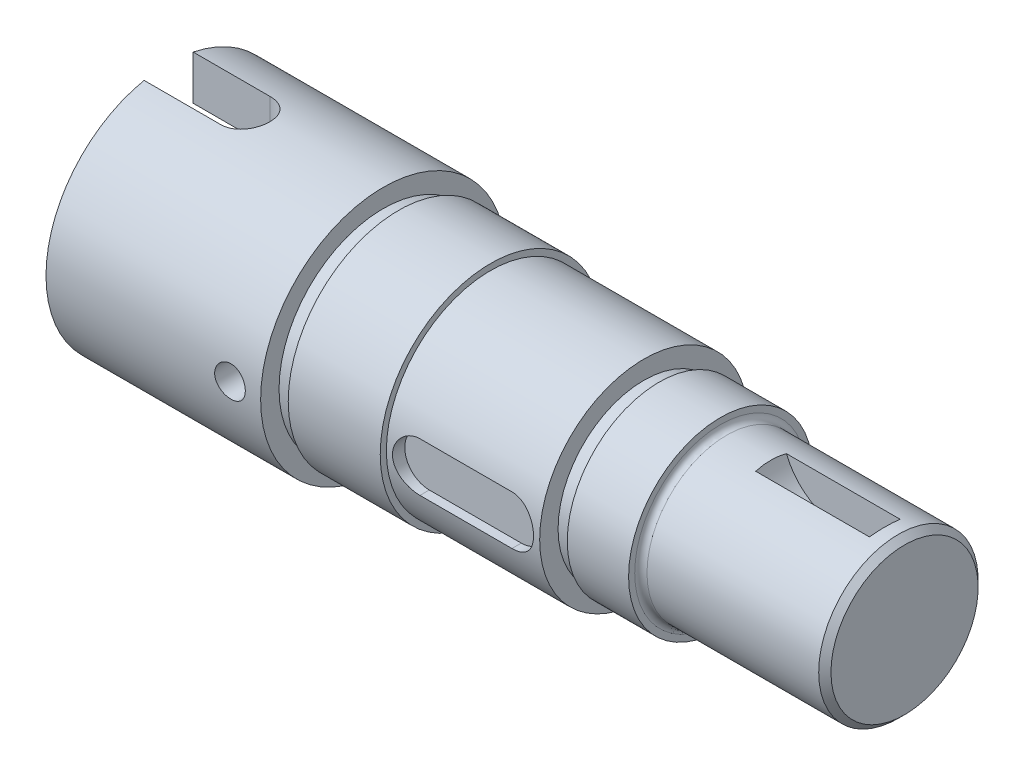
ISO-10303-21;
HEADER;
FILE_DESCRIPTION(('STEP AP214'),'2;1');
FILE_NAME('part.step','',(''),(''),'','','');
FILE_SCHEMA(('AUTOMOTIVE_DESIGN { 1 0 10303 214 1 1 1 1 }'));
ENDSEC;
DATA;
#1=APPLICATION_CONTEXT('core data for automotive mechanical design processes');
#2=APPLICATION_PROTOCOL_DEFINITION('international standard','automotive_design',2000,#1);
#3=PRODUCT_CONTEXT('',#1,'mechanical');
#4=PRODUCT('Part','Part','',(#3));
#5=PRODUCT_RELATED_PRODUCT_CATEGORY('part','',(#4));
#6=PRODUCT_DEFINITION_FORMATION('','',#4);
#7=PRODUCT_DEFINITION_CONTEXT('part definition',#1,'design');
#8=PRODUCT_DEFINITION('design','',#6,#7);
#9=PRODUCT_DEFINITION_SHAPE('','',#8);
#10=(LENGTH_UNIT() NAMED_UNIT(*) SI_UNIT(.MILLI.,.METRE.));
#11=(NAMED_UNIT(*) PLANE_ANGLE_UNIT() SI_UNIT($,.RADIAN.));
#12=(NAMED_UNIT(*) SI_UNIT($,.STERADIAN.) SOLID_ANGLE_UNIT());
#13=UNCERTAINTY_MEASURE_WITH_UNIT(LENGTH_MEASURE(1.E-05),#10,'distance_accuracy_value','');
#14=(GEOMETRIC_REPRESENTATION_CONTEXT(3) GLOBAL_UNCERTAINTY_ASSIGNED_CONTEXT((#13)) GLOBAL_UNIT_ASSIGNED_CONTEXT((#10,
#11,#12)) REPRESENTATION_CONTEXT('',''));
#15=CARTESIAN_POINT('',(0.,0.,0.));
#16=DIRECTION('',(0.,0.,1.));
#17=DIRECTION('',(1.,0.,0.));
#18=AXIS2_PLACEMENT_3D('',#15,#16,#17);
#19=CARTESIAN_POINT('',(-79.0830459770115,0.,0.));
#20=DIRECTION('',(-1.,0.,0.));
#21=DIRECTION('',(0.,0.,1.));
#22=AXIS2_PLACEMENT_3D('',#19,#20,#21);
#23=CYLINDRICAL_SURFACE('',#22,26.);
#24=CARTESIAN_POINT('',(133.,0.,0.));
#25=DIRECTION('',(-1.,0.,0.));
#26=DIRECTION('',(0.,0.,1.));
#27=AXIS2_PLACEMENT_3D('',#24,#25,#26);
#28=CIRCLE('',#27,26.);
#29=CARTESIAN_POINT('',(133.,0.,26.));
#30=VERTEX_POINT('',#29);
#31=EDGE_CURVE('E284',#30,#30,#28,.T.);
#32=ORIENTED_EDGE('',*,*,#31,.T.);
#33=EDGE_LOOP('',(#32));
#34=FACE_BOUND('',#33,.T.);
#35=CARTESIAN_POINT('',(77.,0.,0.));
#36=DIRECTION('',(-1.,0.,0.));
#37=DIRECTION('',(0.,0.,1.));
#38=AXIS2_PLACEMENT_3D('',#35,#36,#37);
#39=CIRCLE('',#38,26.);
#40=CARTESIAN_POINT('',(77.,0.,26.));
#41=VERTEX_POINT('',#40);
#42=EDGE_CURVE('E150',#41,#41,#39,.F.);
#43=ORIENTED_EDGE('',*,*,#42,.T.);
#44=EDGE_LOOP('',(#43));
#45=FACE_BOUND('',#44,.T.);
#46=DIRECTION('',(-1.,0.,0.));
#47=VECTOR('',#46,1.);
#48=CARTESIAN_POINT('',(-79.0830459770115,25.5147016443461,-5.));
#49=LINE('',#48,#47);
#50=CARTESIAN_POINT('',(128.546436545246,25.5147016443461,-5.));
#51=VERTEX_POINT('',#50);
#52=CARTESIAN_POINT('',(91.4535634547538,25.5147016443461,-5.));
#53=VERTEX_POINT('',#52);
#54=EDGE_CURVE('E13',#51,#53,#49,.T.);
#55=ORIENTED_EDGE('',*,*,#54,.F.);
#56=CARTESIAN_POINT('',(128.546436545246,25.5147016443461,-5.));
#57=CARTESIAN_POINT('',(128.572947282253,25.5804320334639,-4.66461591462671));
#58=CARTESIAN_POINT('',(128.596430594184,25.6395804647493,-4.32771059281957));
#59=CARTESIAN_POINT('',(128.637658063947,25.7445842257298,-3.65148855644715));
#60=CARTESIAN_POINT('',(128.655402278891,25.7904396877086,-3.31217186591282));
#61=CARTESIAN_POINT('',(128.685476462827,25.8687522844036,-2.63155464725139));
#62=CARTESIAN_POINT('',(128.697803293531,25.9012016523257,-2.29025308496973));
#63=CARTESIAN_POINT('',(128.717229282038,25.9525855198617,-1.60650914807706));
#64=CARTESIAN_POINT('',(128.724328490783,25.971520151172,-1.26406678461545));
#65=CARTESIAN_POINT('',(128.737839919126,26.0075523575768,-0.247700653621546));
#66=CARTESIAN_POINT('',(128.7369738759,26.0052331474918,0.427111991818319));
#67=CARTESIAN_POINT('',(128.715570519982,25.9481687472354,1.77380414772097));
#68=CARTESIAN_POINT('',(128.695046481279,25.8934589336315,2.44568533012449));
#69=CARTESIAN_POINT('',(128.656676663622,25.7938375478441,3.27158508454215));
#70=CARTESIAN_POINT('',(128.64875554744,25.7733510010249,3.42923498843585));
#71=CARTESIAN_POINT('',(128.631705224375,25.7295029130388,3.7440514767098));
#72=CARTESIAN_POINT('',(128.622576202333,25.7061418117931,3.90121813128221));
#73=CARTESIAN_POINT('',(128.6030384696,25.6564536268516,4.21566490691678));
#74=CARTESIAN_POINT('',(128.592624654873,25.6301147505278,4.37294284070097));
#75=CARTESIAN_POINT('',(128.570507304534,25.5745608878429,4.68692430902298));
#76=CARTESIAN_POINT('',(128.558803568,25.5453454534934,4.84362775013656));
#77=CARTESIAN_POINT('',(128.546436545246,25.5147016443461,5.));
#78=B_SPLINE_CURVE_WITH_KNOTS('',3,(#56,#57,#58,#59,#60,#61,#62,#63,#64,#65,#66,#67,#68,#69,#70,
#71,#72,#73,#74,#75,#76,#77),.UNSPECIFIED.,.F.,.F.,(4,2,2,2,2,2,2,2,2,2,4),(0.,1.02828104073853,
2.05655184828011,3.08541754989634,4.1142732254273,6.13628617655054,8.15693473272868,
8.6344381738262,9.11186862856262,9.59126081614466,10.0707277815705),.UNSPECIFIED.);
#79=CARTESIAN_POINT('',(128.546436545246,25.5147016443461,5.));
#80=VERTEX_POINT('',#79);
#81=EDGE_CURVE('E51',#51,#80,#78,.T.);
#82=ORIENTED_EDGE('',*,*,#81,.T.);
#83=DIRECTION('',(-1.,0.,0.));
#84=VECTOR('',#83,1.);
#85=CARTESIAN_POINT('',(-79.0830459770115,25.5147016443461,5.));
#86=LINE('',#85,#84);
#87=CARTESIAN_POINT('',(91.4535634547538,25.5147016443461,5.));
#88=VERTEX_POINT('',#87);
#89=EDGE_CURVE('E144',#80,#88,#86,.T.);
#90=ORIENTED_EDGE('',*,*,#89,.T.);
#91=CARTESIAN_POINT('',(91.4535634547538,25.5147016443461,5.));
#92=CARTESIAN_POINT('',(91.4270527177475,25.5804320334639,4.66461591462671));
#93=CARTESIAN_POINT('',(91.4035694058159,25.6395804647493,4.32771059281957));
#94=CARTESIAN_POINT('',(91.362341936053,25.7445842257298,3.65148855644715));
#95=CARTESIAN_POINT('',(91.3445977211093,25.7904396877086,3.31217186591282));
#96=CARTESIAN_POINT('',(91.3145235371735,25.8687522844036,2.63155464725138));
#97=CARTESIAN_POINT('',(91.3021967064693,25.9012016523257,2.29025308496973));
#98=CARTESIAN_POINT('',(91.2827707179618,25.9525855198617,1.60650914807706));
#99=CARTESIAN_POINT('',(91.2756715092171,25.971520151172,1.26406678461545));
#100=CARTESIAN_POINT('',(91.2621600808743,26.0075523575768,0.247700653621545));
#101=CARTESIAN_POINT('',(91.2630261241,26.0052331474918,-0.42711199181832));
#102=CARTESIAN_POINT('',(91.2844294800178,25.9481687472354,-1.77380414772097));
#103=CARTESIAN_POINT('',(91.3049535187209,25.8934589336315,-2.44568533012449));
#104=CARTESIAN_POINT('',(91.3433233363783,25.7938375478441,-3.27158508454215));
#105=CARTESIAN_POINT('',(91.3512444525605,25.7733510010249,-3.42923498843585));
#106=CARTESIAN_POINT('',(91.3682947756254,25.7295029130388,-3.7440514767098));
#107=CARTESIAN_POINT('',(91.3774237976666,25.7061418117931,-3.90121813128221));
#108=CARTESIAN_POINT('',(91.3969615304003,25.6564536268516,-4.21566490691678));
#109=CARTESIAN_POINT('',(91.4073753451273,25.6301147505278,-4.37294284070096));
#110=CARTESIAN_POINT('',(91.4294926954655,25.5745608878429,-4.68692430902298));
#111=CARTESIAN_POINT('',(91.4411964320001,25.5453454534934,-4.84362775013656));
#112=CARTESIAN_POINT('',(91.4535634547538,25.5147016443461,-5.));
#113=B_SPLINE_CURVE_WITH_KNOTS('',3,(#91,#92,#93,#94,#95,#96,#97,#98,#99,#100,#101,#102,#103,
#104,#105,#106,#107,#108,#109,#110,#111,#112),.UNSPECIFIED.,.F.,.F.,(4,2,2,2,2,2,2,2,2,2,4),(0.,
1.02828104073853,2.05655184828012,3.08541754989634,4.1142732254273,6.13628617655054,
8.15693473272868,8.6344381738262,9.11186862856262,9.59126081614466,10.0707277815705),.UNSPECIFIED.);
#114=EDGE_CURVE('E149',#88,#53,#113,.T.);
#115=ORIENTED_EDGE('',*,*,#114,.T.);
#116=EDGE_LOOP('',(#55,#82,#90,#115));
#117=FACE_BOUND('',#116,.T.);
#118=ADVANCED_FACE('F43',(#34,#45,#117),#23,.T.);
#119=CARTESIAN_POINT('',(-105.,0.,0.));
#120=DIRECTION('',(1.,0.,0.));
#121=DIRECTION('',(0.,0.,-1.));
#122=AXIS2_PLACEMENT_3D('',#119,#120,#121);
#123=PLANE('',#122);
#124=CARTESIAN_POINT('',(-105.,0.,0.));
#125=DIRECTION('',(-1.,0.,0.));
#126=DIRECTION('',(0.,0.,1.));
#127=AXIS2_PLACEMENT_3D('',#124,#125,#126);
#128=CIRCLE('',#127,40.);
#129=CARTESIAN_POINT('',(-105.,39.1918358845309,-7.99999999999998));
#130=VERTEX_POINT('',#129);
#131=CARTESIAN_POINT('',(-105.,-39.1918358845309,-7.99999999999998));
#132=VERTEX_POINT('',#131);
#133=EDGE_CURVE('E363',#130,#132,#128,.T.);
#134=ORIENTED_EDGE('',*,*,#133,.T.);
#135=DIRECTION('',(0.,1.,0.));
#136=VECTOR('',#135,1.);
#137=CARTESIAN_POINT('',(-105.,-50.,-7.99999999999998));
#138=LINE('',#137,#136);
#139=CARTESIAN_POINT('',(-105.,-24.7184141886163,-7.99999999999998));
#140=VERTEX_POINT('',#139);
#141=EDGE_CURVE('E452',#132,#140,#138,.T.);
#142=ORIENTED_EDGE('',*,*,#141,.T.);
#143=CARTESIAN_POINT('',(-105.,0.,0.));
#144=DIRECTION('',(1.,0.,0.));
#145=DIRECTION('',(0.,0.,-1.));
#146=AXIS2_PLACEMENT_3D('',#143,#144,#145);
#147=CIRCLE('',#146,25.9807621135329);
#148=CARTESIAN_POINT('',(-105.,24.7184141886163,-7.99999999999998));
#149=VERTEX_POINT('',#148);
#150=EDGE_CURVE('E424',#140,#149,#147,.T.);
#151=ORIENTED_EDGE('',*,*,#150,.T.);
#152=EDGE_CURVE('E443',#149,#130,#138,.T.);
#153=ORIENTED_EDGE('',*,*,#152,.T.);
#154=EDGE_LOOP('',(#134,#142,#151,#153));
#155=FACE_BOUND('',#154,.T.);
#156=ADVANCED_FACE('F275',(#155),#123,.F.);
#157=CARTESIAN_POINT('',(-79.0830459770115,0.,0.));
#158=DIRECTION('',(-1.,0.,0.));
#159=DIRECTION('',(0.,0.,1.));
#160=AXIS2_PLACEMENT_3D('',#157,#158,#159);
#161=CYLINDRICAL_SURFACE('',#160,34.);
#162=CARTESIAN_POINT('',(50.,0.,0.));
#163=DIRECTION('',(-1.,0.,0.));
#164=DIRECTION('',(0.,0.,1.));
#165=AXIS2_PLACEMENT_3D('',#162,#163,#164);
#166=CIRCLE('',#165,34.);
#167=CARTESIAN_POINT('',(50.,0.,34.));
#168=VERTEX_POINT('',#167);
#169=EDGE_CURVE('E389',#168,#168,#166,.T.);
#170=ORIENTED_EDGE('',*,*,#169,.T.);
#171=EDGE_LOOP('',(#170));
#172=FACE_BOUND('',#171,.T.);
#173=CARTESIAN_POINT('',(0.,0.,0.));
#174=DIRECTION('',(-1.,0.,0.));
#175=DIRECTION('',(0.,0.,1.));
#176=AXIS2_PLACEMENT_3D('',#173,#174,#175);
#177=CIRCLE('',#176,34.);
#178=CARTESIAN_POINT('',(0.,0.,34.));
#179=VERTEX_POINT('',#178);
#180=EDGE_CURVE('E386',#179,#179,#177,.T.);
#181=ORIENTED_EDGE('',*,*,#180,.F.);
#182=EDGE_LOOP('',(#181));
#183=FACE_BOUND('',#182,.T.);
#184=CARTESIAN_POINT('',(10.,8.,33.0454232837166));
#185=CARTESIAN_POINT('',(9.77832970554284,8.00002761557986,33.0453994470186));
#186=CARTESIAN_POINT('',(9.55666767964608,7.99078790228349,33.0476529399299));
#187=CARTESIAN_POINT('',(9.11499255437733,7.95397655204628,33.0565412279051));
#188=CARTESIAN_POINT('',(8.89497920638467,7.92640773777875,33.0631753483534));
#189=CARTESIAN_POINT('',(8.45856455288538,7.85320789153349,33.0806356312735));
#190=CARTESIAN_POINT('',(8.24215737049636,7.8076100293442,33.0914540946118));
#191=CARTESIAN_POINT('',(7.81407113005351,7.6987327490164,33.1169542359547));
#192=CARTESIAN_POINT('',(7.6023921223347,7.63545314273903,33.1316359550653));
#193=CARTESIAN_POINT('',(7.18527932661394,7.4917287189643,33.1644300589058));
#194=CARTESIAN_POINT('',(6.97984403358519,7.41128807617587,33.1825416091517));
#195=CARTESIAN_POINT('',(6.57647248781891,7.23381155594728,33.2216830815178));
#196=CARTESIAN_POINT('',(6.37853903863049,7.13676954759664,33.2427140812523));
#197=CARTESIAN_POINT('',(5.99155272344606,6.92681819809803,33.2870950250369));
#198=CARTESIAN_POINT('',(5.80249976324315,6.81390902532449,33.310444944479));
#199=CARTESIAN_POINT('',(5.43448108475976,6.5730060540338,33.3588171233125));
#200=CARTESIAN_POINT('',(5.25551578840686,6.44501162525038,33.3838394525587));
#201=CARTESIAN_POINT('',(4.90579514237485,6.17244501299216,33.4353179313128));
#202=CARTESIAN_POINT('',(4.73523708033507,6.02762291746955,33.4617914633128));
#203=CARTESIAN_POINT('',(4.40686699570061,5.72423208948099,33.5150247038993));
#204=CARTESIAN_POINT('',(4.24905511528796,5.56566320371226,33.5417844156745));
#205=CARTESIAN_POINT('',(3.94719977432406,5.2357997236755,33.5948553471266));
#206=CARTESIAN_POINT('',(3.80315866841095,5.06450296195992,33.6211664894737));
#207=CARTESIAN_POINT('',(3.52985757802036,4.71033834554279,33.6726109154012));
#208=CARTESIAN_POINT('',(3.40059720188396,4.5274707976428,33.6977442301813));
#209=CARTESIAN_POINT('',(3.15624067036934,4.1490146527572,33.74644459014));
#210=CARTESIAN_POINT('',(3.0413416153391,3.95329568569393,33.7699881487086));
#211=CARTESIAN_POINT('',(2.8285174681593,3.55264314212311,33.8144840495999));
#212=CARTESIAN_POINT('',(2.73058631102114,3.34771289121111,33.8354373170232));
#213=CARTESIAN_POINT('',(2.55240687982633,2.93000250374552,33.874165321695));
#214=CARTESIAN_POINT('',(2.47215918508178,2.71722211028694,33.8919399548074));
#215=CARTESIAN_POINT('',(2.3300037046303,2.28535194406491,33.9237975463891));
#216=CARTESIAN_POINT('',(2.26809554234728,2.06626230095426,33.9378805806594));
#217=CARTESIAN_POINT('',(2.16408471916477,1.62738161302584,33.9617292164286));
#218=CARTESIAN_POINT('',(2.12164531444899,1.40767432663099,33.9715680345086));
#219=CARTESIAN_POINT('',(2.05530698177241,0.965332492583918,33.9870137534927));
#220=CARTESIAN_POINT('',(2.03140769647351,0.742698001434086,33.9926207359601));
#221=CARTESIAN_POINT('',(2.00235384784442,0.296161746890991,33.9994432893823));
#222=CARTESIAN_POINT('',(1.99719763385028,0.0722600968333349,34.0006592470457));
#223=CARTESIAN_POINT('',(2.00566988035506,-0.375166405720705,33.9986661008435));
#224=CARTESIAN_POINT('',(2.01929813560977,-0.598691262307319,33.9954570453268));
#225=CARTESIAN_POINT('',(2.0647641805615,-1.03927922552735,33.9848126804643));
#226=CARTESIAN_POINT('',(2.0962344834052,-1.25638243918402,33.9774626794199));
#227=CARTESIAN_POINT('',(2.17686391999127,-1.68718107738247,33.9587974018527));
#228=CARTESIAN_POINT('',(2.22602904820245,-1.90087532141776,33.9474807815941));
#229=CARTESIAN_POINT('',(2.34163624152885,-2.32322758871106,33.9211935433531));
#230=CARTESIAN_POINT('',(2.40807251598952,-2.53188727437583,33.9062241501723));
#231=CARTESIAN_POINT('',(2.55774618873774,-2.94290886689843,33.8730249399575));
#232=CARTESIAN_POINT('',(2.6409898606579,-3.14526838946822,33.8547939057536));
#233=CARTESIAN_POINT('',(2.82436563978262,-3.54383560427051,33.815405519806));
#234=CARTESIAN_POINT('',(2.92462558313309,-3.739982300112,33.7942262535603));
#235=CARTESIAN_POINT('',(3.14088159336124,-4.12321741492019,33.7496120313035));
#236=CARTESIAN_POINT('',(3.25688308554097,-4.31030268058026,33.7261762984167));
#237=CARTESIAN_POINT('',(3.50378141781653,-4.67412805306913,33.6776811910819));
#238=CARTESIAN_POINT('',(3.63467725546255,-4.85086885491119,33.6526219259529));
#239=CARTESIAN_POINT('',(3.9104944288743,-5.19289794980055,33.6015433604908));
#240=CARTESIAN_POINT('',(4.0554160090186,-5.35818604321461,33.5755240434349));
#241=CARTESIAN_POINT('',(4.36199797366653,-5.68009865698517,33.5225853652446));
#242=CARTESIAN_POINT('',(4.523977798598,-5.83641803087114,33.4956594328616));
#243=CARTESIAN_POINT('',(4.86051678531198,-6.13484108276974,33.4422891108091));
#244=CARTESIAN_POINT('',(5.03507173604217,-6.27694948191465,33.4158445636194));
#245=CARTESIAN_POINT('',(5.39576772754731,-6.54612217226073,33.3641586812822));
#246=CARTESIAN_POINT('',(5.58191617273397,-6.67317669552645,33.3389181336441));
#247=CARTESIAN_POINT('',(5.96438029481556,-6.91118551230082,33.2903930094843));
#248=CARTESIAN_POINT('',(6.16069203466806,-7.02214597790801,33.2671076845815));
#249=CARTESIAN_POINT('',(6.56319118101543,-7.22770053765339,33.2230560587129));
#250=CARTESIAN_POINT('',(6.7694217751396,-7.32221284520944,33.2023024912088));
#251=CARTESIAN_POINT('',(7.18934662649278,-7.49343836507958,33.1640781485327));
#252=CARTESIAN_POINT('',(7.40303788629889,-7.57015863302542,33.1466060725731));
#253=CARTESIAN_POINT('',(7.83619595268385,-7.70515169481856,33.1154863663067));
#254=CARTESIAN_POINT('',(8.05565652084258,-7.76344359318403,33.1018347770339));
#255=CARTESIAN_POINT('',(8.49886324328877,-7.86117371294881,33.0787615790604));
#256=CARTESIAN_POINT('',(8.72260732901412,-7.90062080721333,33.0693379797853));
#257=CARTESIAN_POINT('',(9.12213524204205,-7.95363631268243,33.0566218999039));
#258=CARTESIAN_POINT('',(9.29739314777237,-7.97102886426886,33.0524273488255));
#259=CARTESIAN_POINT('',(9.64842899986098,-7.9942055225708,33.046825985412));
#260=CARTESIAN_POINT('',(9.82420561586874,-8.00000868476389,33.0454145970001));
#261=CARTESIAN_POINT('',(10.,-8.,33.0454232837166));
#262=B_SPLINE_CURVE_WITH_KNOTS('',3,(#184,#185,#186,#187,#188,#189,#190,#191,#192,#193,#194,
#195,#196,#197,#198,#199,#200,#201,#202,#203,#204,#205,#206,#207,#208,#209,#210,#211,#212,#213,
#214,#215,#216,#217,#218,#219,#220,#221,#222,#223,#224,#225,#226,#227,#228,#229,#230,#231,#232,
#233,#234,#235,#236,#237,#238,#239,#240,#241,#242,#243,#244,#245,#246,#247,#248,#249,#250,#251,
#252,#253,#254,#255,#256,#257,#258,#259,#260,#261),.UNSPECIFIED.,.F.,.F.,(4,2,2,2,2,2,2,2,2,2,2,
2,2,2,2,2,2,2,2,2,2,2,2,2,2,2,2,2,2,2,2,2,2,2,2,2,2,2,4),(0.,0.664794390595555,1.32948642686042,
1.99296121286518,2.65644305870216,3.31976368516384,3.98332980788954,4.64688888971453,
5.3104757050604,5.9856204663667,6.66077275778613,7.33604028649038,8.01128991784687,
8.69497437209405,9.37841394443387,10.0618759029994,10.7453238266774,11.4164579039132,
12.0875790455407,12.75864108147,13.4296957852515,14.0874065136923,14.7453402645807,
15.4030537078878,16.0610131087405,16.7241540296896,17.3875240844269,18.0508495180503,
18.7141865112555,19.3935240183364,20.0726350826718,20.752184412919,21.4314724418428,
22.1140472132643,22.7963508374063,23.4779447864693,24.1592174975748,24.6873340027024,
25.2145814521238),.UNSPECIFIED.);
#263=CARTESIAN_POINT('',(10.,8.,33.0454232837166));
#264=VERTEX_POINT('',#263);
#265=CARTESIAN_POINT('',(10.,-8.,33.0454232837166));
#266=VERTEX_POINT('',#265);
#267=EDGE_CURVE('E307',#264,#266,#262,.T.);
#268=ORIENTED_EDGE('',*,*,#267,.F.);
#269=DIRECTION('',(-1.,0.,0.));
#270=VECTOR('',#269,1.);
#271=CARTESIAN_POINT('',(-79.0830459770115,8.,33.0454232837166));
#272=LINE('',#271,#270);
#273=CARTESIAN_POINT('',(40.,8.,33.0454232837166));
#274=VERTEX_POINT('',#273);
#275=EDGE_CURVE('E248',#274,#264,#272,.T.);
#276=ORIENTED_EDGE('',*,*,#275,.F.);
#277=CARTESIAN_POINT('',(40.,-8.,33.0454232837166));
#278=CARTESIAN_POINT('',(40.2216702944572,-8.00002761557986,33.0453994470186));
#279=CARTESIAN_POINT('',(40.4433323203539,-7.99078790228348,33.0476529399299));
#280=CARTESIAN_POINT('',(40.8850074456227,-7.95397655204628,33.0565412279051));
#281=CARTESIAN_POINT('',(41.1050207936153,-7.92640773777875,33.0631753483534));
#282=CARTESIAN_POINT('',(41.5414354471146,-7.85320789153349,33.0806356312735));
#283=CARTESIAN_POINT('',(41.7578426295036,-7.8076100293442,33.0914540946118));
#284=CARTESIAN_POINT('',(42.1859288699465,-7.6987327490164,33.1169542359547));
#285=CARTESIAN_POINT('',(42.3976078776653,-7.63545314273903,33.1316359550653));
#286=CARTESIAN_POINT('',(42.8147206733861,-7.49172871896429,33.1644300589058));
#287=CARTESIAN_POINT('',(43.0201559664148,-7.41128807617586,33.1825416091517));
#288=CARTESIAN_POINT('',(43.4235275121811,-7.23381155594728,33.2216830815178));
#289=CARTESIAN_POINT('',(43.6214609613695,-7.13676954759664,33.2427140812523));
#290=CARTESIAN_POINT('',(44.0084472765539,-6.92681819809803,33.2870950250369));
#291=CARTESIAN_POINT('',(44.1975002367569,-6.81390902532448,33.310444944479));
#292=CARTESIAN_POINT('',(44.5655189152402,-6.57300605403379,33.3588171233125));
#293=CARTESIAN_POINT('',(44.7444842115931,-6.44501162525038,33.3838394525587));
#294=CARTESIAN_POINT('',(45.0942048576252,-6.17244501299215,33.4353179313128));
#295=CARTESIAN_POINT('',(45.2647629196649,-6.02762291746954,33.4617914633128));
#296=CARTESIAN_POINT('',(45.5931330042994,-5.72423208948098,33.5150247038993));
#297=CARTESIAN_POINT('',(45.750944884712,-5.56566320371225,33.5417844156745));
#298=CARTESIAN_POINT('',(46.052800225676,-5.23579972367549,33.5948553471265));
#299=CARTESIAN_POINT('',(46.196841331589,-5.06450296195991,33.6211664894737));
#300=CARTESIAN_POINT('',(46.4701424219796,-4.71033834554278,33.6726109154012));
#301=CARTESIAN_POINT('',(46.599402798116,-4.5274707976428,33.6977442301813));
#302=CARTESIAN_POINT('',(46.8437593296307,-4.14901465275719,33.74644459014));
#303=CARTESIAN_POINT('',(46.9586583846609,-3.95329568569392,33.7699881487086));
#304=CARTESIAN_POINT('',(47.1714825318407,-3.5526431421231,33.8144840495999));
#305=CARTESIAN_POINT('',(47.2694136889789,-3.3477128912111,33.8354373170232));
#306=CARTESIAN_POINT('',(47.4475931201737,-2.93000250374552,33.874165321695));
#307=CARTESIAN_POINT('',(47.5278408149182,-2.71722211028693,33.8919399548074));
#308=CARTESIAN_POINT('',(47.6699962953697,-2.2853519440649,33.9237975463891));
#309=CARTESIAN_POINT('',(47.7319044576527,-2.06626230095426,33.9378805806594));
#310=CARTESIAN_POINT('',(47.8359152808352,-1.62738161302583,33.9617292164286));
#311=CARTESIAN_POINT('',(47.878354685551,-1.40767432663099,33.9715680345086));
#312=CARTESIAN_POINT('',(47.9446930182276,-0.965332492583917,33.9870137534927));
#313=CARTESIAN_POINT('',(47.9685923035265,-0.742698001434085,33.9926207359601));
#314=CARTESIAN_POINT('',(47.9976461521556,-0.296161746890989,33.9994432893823));
#315=CARTESIAN_POINT('',(48.0028023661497,-0.0722600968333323,34.0006592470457));
#316=CARTESIAN_POINT('',(47.9943301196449,0.375166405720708,33.9986661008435));
#317=CARTESIAN_POINT('',(47.9807018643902,0.598691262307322,33.9954570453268));
#318=CARTESIAN_POINT('',(47.9352358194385,1.03927922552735,33.9848126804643));
#319=CARTESIAN_POINT('',(47.9037655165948,1.25638243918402,33.9774626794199));
#320=CARTESIAN_POINT('',(47.8231360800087,1.68718107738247,33.9587974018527));
#321=CARTESIAN_POINT('',(47.7739709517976,1.90087532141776,33.9474807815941));
#322=CARTESIAN_POINT('',(47.6583637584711,2.32322758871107,33.9211935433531));
#323=CARTESIAN_POINT('',(47.5919274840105,2.53188727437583,33.9062241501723));
#324=CARTESIAN_POINT('',(47.4422538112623,2.94290886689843,33.8730249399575));
#325=CARTESIAN_POINT('',(47.3590101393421,3.14526838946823,33.8547939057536));
#326=CARTESIAN_POINT('',(47.1756343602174,3.54383560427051,33.815405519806));
#327=CARTESIAN_POINT('',(47.0753744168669,3.73998230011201,33.7942262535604));
#328=CARTESIAN_POINT('',(46.8591184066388,4.12321741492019,33.7496120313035));
#329=CARTESIAN_POINT('',(46.743116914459,4.31030268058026,33.7261762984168));
#330=CARTESIAN_POINT('',(46.4962185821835,4.67412805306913,33.6776811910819));
#331=CARTESIAN_POINT('',(46.3653227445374,4.85086885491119,33.6526219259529));
#332=CARTESIAN_POINT('',(46.0895055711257,5.19289794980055,33.6015433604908));
#333=CARTESIAN_POINT('',(45.9445839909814,5.35818604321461,33.5755240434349));
#334=CARTESIAN_POINT('',(45.6380020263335,5.68009865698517,33.5225853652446));
#335=CARTESIAN_POINT('',(45.476022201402,5.83641803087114,33.4956594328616));
#336=CARTESIAN_POINT('',(45.139483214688,6.13484108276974,33.4422891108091));
#337=CARTESIAN_POINT('',(44.9649282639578,6.27694948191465,33.4158445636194));
#338=CARTESIAN_POINT('',(44.6042322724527,6.54612217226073,33.3641586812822));
#339=CARTESIAN_POINT('',(44.418083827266,6.67317669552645,33.3389181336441));
#340=CARTESIAN_POINT('',(44.0356197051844,6.91118551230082,33.2903930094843));
#341=CARTESIAN_POINT('',(43.8393079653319,7.02214597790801,33.2671076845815));
#342=CARTESIAN_POINT('',(43.4368088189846,7.22770053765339,33.2230560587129));
#343=CARTESIAN_POINT('',(43.2305782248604,7.32221284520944,33.2023024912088));
#344=CARTESIAN_POINT('',(42.8106533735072,7.49343836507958,33.1640781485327));
#345=CARTESIAN_POINT('',(42.5969621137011,7.57015863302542,33.1466060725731));
#346=CARTESIAN_POINT('',(42.1638040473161,7.70515169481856,33.1154863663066));
#347=CARTESIAN_POINT('',(41.9443434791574,7.76344359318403,33.1018347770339));
#348=CARTESIAN_POINT('',(41.5011367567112,7.86117371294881,33.0787615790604));
#349=CARTESIAN_POINT('',(41.2773926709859,7.90062080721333,33.0693379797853));
#350=CARTESIAN_POINT('',(40.877864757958,7.95363631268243,33.0566218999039));
#351=CARTESIAN_POINT('',(40.7026068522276,7.97102886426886,33.0524273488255));
#352=CARTESIAN_POINT('',(40.351571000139,7.9942055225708,33.046825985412));
#353=CARTESIAN_POINT('',(40.1757943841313,8.00000868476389,33.0454145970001));
#354=CARTESIAN_POINT('',(40.,8.,33.0454232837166));
#355=B_SPLINE_CURVE_WITH_KNOTS('',3,(#277,#278,#279,#280,#281,#282,#283,#284,#285,#286,#287,
#288,#289,#290,#291,#292,#293,#294,#295,#296,#297,#298,#299,#300,#301,#302,#303,#304,#305,#306,
#307,#308,#309,#310,#311,#312,#313,#314,#315,#316,#317,#318,#319,#320,#321,#322,#323,#324,#325,
#326,#327,#328,#329,#330,#331,#332,#333,#334,#335,#336,#337,#338,#339,#340,#341,#342,#343,#344,
#345,#346,#347,#348,#349,#350,#351,#352,#353,#354),.UNSPECIFIED.,.F.,.F.,(4,2,2,2,2,2,2,2,2,2,2,
2,2,2,2,2,2,2,2,2,2,2,2,2,2,2,2,2,2,2,2,2,2,2,2,2,2,2,4),(0.,0.664794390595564,1.32948642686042,
1.99296121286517,2.65644305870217,3.31976368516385,3.98332980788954,4.64688888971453,
5.3104757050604,5.98562046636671,6.66077275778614,7.33604028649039,8.01128991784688,
8.69497437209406,9.37841394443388,10.0618759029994,10.7453238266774,11.4164579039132,
12.0875790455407,12.75864108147,13.4296957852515,14.0874065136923,14.7453402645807,
15.4030537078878,16.0610131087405,16.7241540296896,17.3875240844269,18.0508495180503,
18.7141865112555,19.3935240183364,20.0726350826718,20.752184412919,21.4314724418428,
22.1140472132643,22.7963508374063,23.4779447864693,24.1592174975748,24.6873340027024,
25.2145814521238),.UNSPECIFIED.);
#356=CARTESIAN_POINT('',(40.,-8.,33.0454232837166));
#357=VERTEX_POINT('',#356);
#358=EDGE_CURVE('E325',#357,#274,#355,.T.);
#359=ORIENTED_EDGE('',*,*,#358,.F.);
#360=DIRECTION('',(-1.,0.,0.));
#361=VECTOR('',#360,1.);
#362=CARTESIAN_POINT('',(-79.0830459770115,-8.,33.0454232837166));
#363=LINE('',#362,#361);
#364=EDGE_CURVE('E308',#266,#357,#363,.F.);
#365=ORIENTED_EDGE('',*,*,#364,.F.);
#366=EDGE_LOOP('',(#268,#276,#359,#365));
#367=FACE_BOUND('',#366,.T.);
#368=ADVANCED_FACE('F280',(#172,#183,#367),#161,.T.);
#369=CARTESIAN_POINT('',(-105.,-39.1918358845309,8.00000000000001));
#370=VERTEX_POINT('',#369);
#371=CARTESIAN_POINT('',(-105.,39.1918358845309,8.00000000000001));
#372=VERTEX_POINT('',#371);
#373=EDGE_CURVE('E365',#370,#372,#128,.T.);
#374=ORIENTED_EDGE('',*,*,#373,.T.);
#375=DIRECTION('',(0.,1.,0.));
#376=VECTOR('',#375,1.);
#377=CARTESIAN_POINT('',(-105.,-50.,8.00000000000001));
#378=LINE('',#377,#376);
#379=CARTESIAN_POINT('',(-105.,24.7184141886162,8.00000000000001));
#380=VERTEX_POINT('',#379);
#381=EDGE_CURVE('E449',#380,#372,#378,.T.);
#382=ORIENTED_EDGE('',*,*,#381,.F.);
#383=CARTESIAN_POINT('',(-105.,-24.7184141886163,8.));
#384=VERTEX_POINT('',#383);
#385=EDGE_CURVE('E423',#380,#384,#147,.T.);
#386=ORIENTED_EDGE('',*,*,#385,.T.);
#387=EDGE_CURVE('E448',#370,#384,#378,.T.);
#388=ORIENTED_EDGE('',*,*,#387,.F.);
#389=EDGE_LOOP('',(#374,#382,#386,#388));
#390=FACE_BOUND('',#389,.T.);
#391=ADVANCED_FACE('F229',(#390),#123,.F.);
#392=CARTESIAN_POINT('',(-79.0830459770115,0.,0.));
#393=DIRECTION('',(-1.,0.,0.));
#394=DIRECTION('',(0.,0.,1.));
#395=AXIS2_PLACEMENT_3D('',#392,#393,#394);
#396=CYLINDRICAL_SURFACE('',#395,40.);
#397=CARTESIAN_POINT('',(-40.,0.,40.));
#398=CARTESIAN_POINT('',(-39.9999983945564,-0.139890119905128,40.0000005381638));
#399=CARTESIAN_POINT('',(-40.0058728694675,-0.279756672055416,39.9992647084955));
#400=CARTESIAN_POINT('',(-40.0293256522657,-0.55853414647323,39.9963430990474));
#401=CARTESIAN_POINT('',(-40.0469066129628,-0.697444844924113,39.9941569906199));
#402=CARTESIAN_POINT('',(-40.0936632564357,-0.973374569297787,39.9883933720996));
#403=CARTESIAN_POINT('',(-40.1228475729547,-1.11039210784,39.984814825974));
#404=CARTESIAN_POINT('',(-40.1926066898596,-1.3815095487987,39.9763659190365));
#405=CARTESIAN_POINT('',(-40.2331856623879,-1.51560836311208,39.9714950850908));
#406=CARTESIAN_POINT('',(-40.3253831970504,-1.77974867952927,39.9606049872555));
#407=CARTESIAN_POINT('',(-40.3769901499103,-1.90979428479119,39.9545869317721));
#408=CARTESIAN_POINT('',(-40.4909157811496,-2.16511159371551,39.9415653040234));
#409=CARTESIAN_POINT('',(-40.5532384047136,-2.29038151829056,39.9345613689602));
#410=CARTESIAN_POINT('',(-40.6880988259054,-2.53515746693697,39.9197695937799));
#411=CARTESIAN_POINT('',(-40.7606310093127,-2.65466661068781,39.9119821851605));
#412=CARTESIAN_POINT('',(-40.9154521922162,-2.8872111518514,39.8958344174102));
#413=CARTESIAN_POINT('',(-40.9977448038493,-3.00024412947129,39.8874738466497));
#414=CARTESIAN_POINT('',(-41.1718849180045,-3.21950680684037,39.870376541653));
#415=CARTESIAN_POINT('',(-41.2637741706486,-3.32570323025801,39.8616382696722));
#416=CARTESIAN_POINT('',(-41.4561875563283,-3.5300274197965,39.8440638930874));
#417=CARTESIAN_POINT('',(-41.5567148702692,-3.62815218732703,39.8352277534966));
#418=CARTESIAN_POINT('',(-41.7656412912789,-3.81557488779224,39.8177127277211));
#419=CARTESIAN_POINT('',(-41.8740378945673,-3.90487560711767,39.8090337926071));
#420=CARTESIAN_POINT('',(-42.0980181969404,-4.0740900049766,39.7920724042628));
#421=CARTESIAN_POINT('',(-42.2136045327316,-4.15400020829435,39.7837900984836));
#422=CARTESIAN_POINT('',(-42.4514813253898,-4.30405460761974,39.767836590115));
#423=CARTESIAN_POINT('',(-42.5737908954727,-4.37416871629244,39.7601672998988));
#424=CARTESIAN_POINT('',(-42.8239767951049,-4.50386359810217,39.7456849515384));
#425=CARTESIAN_POINT('',(-42.9518551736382,-4.56344045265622,39.7388722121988));
#426=CARTESIAN_POINT('',(-43.2121914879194,-4.67157237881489,39.7263059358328));
#427=CARTESIAN_POINT('',(-43.3446475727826,-4.72013184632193,39.7205519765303));
#428=CARTESIAN_POINT('',(-43.6132414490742,-4.80591459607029,39.7102634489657));
#429=CARTESIAN_POINT('',(-43.7493805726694,-4.84313371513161,39.7057293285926));
#430=CARTESIAN_POINT('',(-44.1603297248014,-4.9369446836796,39.6942156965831));
#431=CARTESIAN_POINT('',(-44.4393360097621,-4.97637915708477,39.689242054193));
#432=CARTESIAN_POINT('',(-44.9998950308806,-5.00788537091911,39.6852781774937));
#433=CARTESIAN_POINT('',(-45.281447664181,-4.99995901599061,39.6862877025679));
#434=CARTESIAN_POINT('',(-45.8375983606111,-4.93723068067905,39.6941397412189));
#435=CARTESIAN_POINT('',(-46.1122269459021,-4.88269650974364,39.7009489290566));
#436=CARTESIAN_POINT('',(-46.6483930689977,-4.72870178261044,39.7195838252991));
#437=CARTESIAN_POINT('',(-46.9099303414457,-4.62924031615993,39.7314096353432));
#438=CARTESIAN_POINT('',(-47.4133351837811,-4.38793084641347,39.7587823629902));
#439=CARTESIAN_POINT('',(-47.6551463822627,-4.24596643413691,39.7743394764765));
#440=CARTESIAN_POINT('',(-48.1116136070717,-3.92376301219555,39.8074142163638));
#441=CARTESIAN_POINT('',(-48.3262683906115,-3.74352225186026,39.8249319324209));
#442=CARTESIAN_POINT('',(-48.7238853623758,-3.34839820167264,39.8601022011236));
#443=CARTESIAN_POINT('',(-48.9066181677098,-3.13328401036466,39.8777548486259));
#444=CARTESIAN_POINT('',(-49.2334177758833,-2.67531434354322,39.9110926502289));
#445=CARTESIAN_POINT('',(-49.3774844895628,-2.43245880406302,39.9267777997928));
#446=CARTESIAN_POINT('',(-49.6228626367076,-1.92572334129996,39.954423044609));
#447=CARTESIAN_POINT('',(-49.7241597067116,-1.66183639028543,39.9663818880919));
#448=CARTESIAN_POINT('',(-49.8809409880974,-1.12061588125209,39.9852157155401));
#449=CARTESIAN_POINT('',(-49.9364273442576,-0.843282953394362,39.9920909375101));
#450=CARTESIAN_POINT('',(-49.9997148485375,-0.285026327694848,39.9999519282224));
#451=CARTESIAN_POINT('',(-50.0078319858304,-0.00413898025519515,40.0009767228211));
#452=CARTESIAN_POINT('',(-49.9769845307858,0.554992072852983,39.9971267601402));
#453=CARTESIAN_POINT('',(-49.9380209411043,0.83323583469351,39.9922521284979));
#454=CARTESIAN_POINT('',(-49.8143805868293,1.37824901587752,39.9771753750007));
#455=CARTESIAN_POINT('',(-49.7298544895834,1.64505314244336,39.9669908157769));
#456=CARTESIAN_POINT('',(-49.5176450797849,2.1606993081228,39.9424344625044));
#457=CARTESIAN_POINT('',(-49.3899603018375,2.40954073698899,39.9280625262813));
#458=CARTESIAN_POINT('',(-49.0942937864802,2.88360904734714,39.8966364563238));
#459=CARTESIAN_POINT('',(-48.9261076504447,3.10870754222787,39.8795688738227));
#460=CARTESIAN_POINT('',(-48.5545007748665,3.52759395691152,39.8447028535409));
#461=CARTESIAN_POINT('',(-48.3510786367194,3.72138063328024,39.8269043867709));
#462=CARTESIAN_POINT('',(-47.9133860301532,4.07326400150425,39.7924620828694));
#463=CARTESIAN_POINT('',(-47.6789465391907,4.23115123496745,39.775825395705));
#464=CARTESIAN_POINT('',(-47.1866802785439,4.50530546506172,39.7457083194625));
#465=CARTESIAN_POINT('',(-46.9288539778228,4.62157329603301,39.7322278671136));
#466=CARTESIAN_POINT('',(-46.397861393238,4.80885432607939,39.7099966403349));
#467=CARTESIAN_POINT('',(-46.1247371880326,4.87998560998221,39.7012335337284));
#468=CARTESIAN_POINT('',(-45.5701501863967,4.97533563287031,39.6893996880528));
#469=CARTESIAN_POINT('',(-45.2886877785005,4.99955655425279,39.686328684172));
#470=CARTESIAN_POINT('',(-44.8677050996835,5.00021203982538,39.686241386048));
#471=CARTESIAN_POINT('',(-44.7279907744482,4.99455342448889,39.68695676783));
#472=CARTESIAN_POINT('',(-44.4495544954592,4.97156759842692,39.6898435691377));
#473=CARTESIAN_POINT('',(-44.3108321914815,4.9542447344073,39.6920144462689));
#474=CARTESIAN_POINT('',(-44.0353129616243,4.90804527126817,39.6977533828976));
#475=CARTESIAN_POINT('',(-43.8985167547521,4.87916447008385,39.7013219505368));
#476=CARTESIAN_POINT('',(-43.6279062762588,4.81007786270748,39.7097514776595));
#477=CARTESIAN_POINT('',(-43.4940909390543,4.76987617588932,39.7146119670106));
#478=CARTESIAN_POINT('',(-43.2303355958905,4.67843682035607,39.7254873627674));
#479=CARTESIAN_POINT('',(-43.1003955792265,4.6271991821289,39.731502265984));
#480=CARTESIAN_POINT('',(-42.8453429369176,4.51407883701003,39.7445132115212));
#481=CARTESIAN_POINT('',(-42.7202285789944,4.45219999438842,39.7515088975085));
#482=CARTESIAN_POINT('',(-42.4755993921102,4.3182008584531,39.766288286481));
#483=CARTESIAN_POINT('',(-42.356086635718,4.24607681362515,39.7740722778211));
#484=CARTESIAN_POINT('',(-42.1235755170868,4.09214062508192,39.7902044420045));
#485=CARTESIAN_POINT('',(-42.0105748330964,4.01033196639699,39.7985524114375));
#486=CARTESIAN_POINT('',(-41.7910456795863,3.83696646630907,39.8156417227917));
#487=CARTESIAN_POINT('',(-41.684568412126,3.74534501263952,39.8243854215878));
#488=CARTESIAN_POINT('',(-41.4797382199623,3.55351080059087,39.8419606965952));
#489=CARTESIAN_POINT('',(-41.3813823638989,3.45330116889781,39.8507922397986));
#490=CARTESIAN_POINT('',(-41.1933806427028,3.24489676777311,39.8683029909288));
#491=CARTESIAN_POINT('',(-41.1037400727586,3.13669721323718,39.8769821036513));
#492=CARTESIAN_POINT('',(-40.9338976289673,2.91316118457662,39.8939349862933));
#493=CARTESIAN_POINT('',(-40.8536922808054,2.79782736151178,39.9022089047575));
#494=CARTESIAN_POINT('',(-40.7029347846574,2.56029300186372,39.9181553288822));
#495=CARTESIAN_POINT('',(-40.6324244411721,2.43806574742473,39.925825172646));
#496=CARTESIAN_POINT('',(-40.5019893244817,2.1880968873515,39.9403041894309));
#497=CARTESIAN_POINT('',(-40.4420606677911,2.06035732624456,39.9471136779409));
#498=CARTESIAN_POINT('',(-40.3332371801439,1.80032528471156,39.9596765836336));
#499=CARTESIAN_POINT('',(-40.2843337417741,1.66803644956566,39.9654308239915));
#500=CARTESIAN_POINT('',(-40.197874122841,1.39980201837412,39.9757248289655));
#501=CARTESIAN_POINT('',(-40.1603152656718,1.26385729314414,39.9802648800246));
#502=CARTESIAN_POINT('',(-40.0859095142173,0.942088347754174,39.9893293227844));
#503=CARTESIAN_POINT('',(-40.0537266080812,0.755150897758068,39.993314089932));
#504=CARTESIAN_POINT('',(-40.0107730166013,0.378794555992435,39.9986490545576));
#505=CARTESIAN_POINT('',(-40.0000021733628,0.189375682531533,39.999999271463));
#506=CARTESIAN_POINT('',(-40.,0.,40.));
#507=B_SPLINE_CURVE_WITH_KNOTS('',3,(#397,#398,#399,#400,#401,#402,#403,#404,#405,#406,#407,
#408,#409,#410,#411,#412,#413,#414,#415,#416,#417,#418,#419,#420,#421,#422,#423,#424,#425,#426,
#427,#428,#429,#430,#431,#432,#433,#434,#435,#436,#437,#438,#439,#440,#441,#442,#443,#444,#445,
#446,#447,#448,#449,#450,#451,#452,#453,#454,#455,#456,#457,#458,#459,#460,#461,#462,#463,#464,
#465,#466,#467,#468,#469,#470,#471,#472,#473,#474,#475,#476,#477,#478,#479,#480,#481,#482,#483,
#484,#485,#486,#487,#488,#489,#490,#491,#492,#493,#494,#495,#496,#497,#498,#499,#500,#501,#502,
#503,#504,#505,#506),.UNSPECIFIED.,.T.,.F.,(4,2,2,2,2,2,2,2,2,2,2,2,2,2,2,2,2,2,2,2,2,2,2,2,2,2,
2,2,2,2,2,2,2,2,2,2,2,2,2,2,2,2,2,2,2,2,2,2,2,2,2,2,2,2,4),(0.,0.419504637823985,
0.839104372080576,1.2590169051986,1.67908338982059,2.09870982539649,2.51849108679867,
2.93804240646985,3.35774948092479,3.7793652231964,4.20113689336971,4.62277495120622,
5.04456855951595,5.46763043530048,5.89084930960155,6.31389902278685,6.73710385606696,
7.57817257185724,8.4192074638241,9.25544199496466,10.0916934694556,10.9302565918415,
11.7688580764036,12.6132576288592,13.4576591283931,14.3023439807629,15.1469892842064,
15.9859936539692,16.8249801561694,17.6612091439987,18.4974665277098,19.3380361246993,
20.1786390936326,21.0240274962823,21.8693989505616,22.7125495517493,23.5556609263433,
23.9747450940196,24.3936731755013,24.8127537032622,25.2316819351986,25.6506090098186,
26.0693842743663,26.4883132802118,26.9070919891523,27.3288208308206,27.7503967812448,
28.1722272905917,28.5939019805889,29.0173414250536,29.4406251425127,29.8635772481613,
30.2864294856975,30.8543363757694,31.4222390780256),.UNSPECIFIED.);
#508=CARTESIAN_POINT('',(-40.,0.,40.));
#509=VERTEX_POINT('',#508);
#510=EDGE_CURVE('E242',#509,#509,#507,.T.);
#511=ORIENTED_EDGE('',*,*,#510,.T.);
#512=EDGE_LOOP('',(#511));
#513=FACE_BOUND('',#512,.T.);
#514=CARTESIAN_POINT('',(-40.,0.,-40.));
#515=CARTESIAN_POINT('',(-39.9999983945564,0.139890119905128,-40.0000005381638));
#516=CARTESIAN_POINT('',(-40.0058728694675,0.279756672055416,-39.9992647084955));
#517=CARTESIAN_POINT('',(-40.0293256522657,0.55853414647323,-39.9963430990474));
#518=CARTESIAN_POINT('',(-40.0469066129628,0.697444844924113,-39.9941569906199));
#519=CARTESIAN_POINT('',(-40.0936632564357,0.973374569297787,-39.9883933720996));
#520=CARTESIAN_POINT('',(-40.1228475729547,1.11039210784,-39.984814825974));
#521=CARTESIAN_POINT('',(-40.1926066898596,1.3815095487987,-39.9763659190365));
#522=CARTESIAN_POINT('',(-40.2331856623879,1.51560836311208,-39.9714950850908));
#523=CARTESIAN_POINT('',(-40.3253831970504,1.77974867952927,-39.9606049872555));
#524=CARTESIAN_POINT('',(-40.3769901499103,1.90979428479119,-39.9545869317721));
#525=CARTESIAN_POINT('',(-40.4909157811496,2.16511159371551,-39.9415653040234));
#526=CARTESIAN_POINT('',(-40.5532384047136,2.29038151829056,-39.9345613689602));
#527=CARTESIAN_POINT('',(-40.6880988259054,2.53515746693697,-39.9197695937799));
#528=CARTESIAN_POINT('',(-40.7606310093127,2.65466661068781,-39.9119821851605));
#529=CARTESIAN_POINT('',(-40.9154521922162,2.8872111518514,-39.8958344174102));
#530=CARTESIAN_POINT('',(-40.9977448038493,3.00024412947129,-39.8874738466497));
#531=CARTESIAN_POINT('',(-41.1718849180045,3.21950680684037,-39.870376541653));
#532=CARTESIAN_POINT('',(-41.2637741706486,3.32570323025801,-39.8616382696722));
#533=CARTESIAN_POINT('',(-41.4561875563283,3.5300274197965,-39.8440638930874));
#534=CARTESIAN_POINT('',(-41.5567148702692,3.62815218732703,-39.8352277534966));
#535=CARTESIAN_POINT('',(-41.7656412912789,3.81557488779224,-39.8177127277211));
#536=CARTESIAN_POINT('',(-41.8740378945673,3.90487560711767,-39.8090337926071));
#537=CARTESIAN_POINT('',(-42.0980181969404,4.0740900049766,-39.7920724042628));
#538=CARTESIAN_POINT('',(-42.2136045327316,4.15400020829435,-39.7837900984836));
#539=CARTESIAN_POINT('',(-42.4514813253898,4.30405460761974,-39.767836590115));
#540=CARTESIAN_POINT('',(-42.5737908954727,4.37416871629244,-39.7601672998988));
#541=CARTESIAN_POINT('',(-42.8239767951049,4.50386359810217,-39.7456849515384));
#542=CARTESIAN_POINT('',(-42.9518551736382,4.56344045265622,-39.7388722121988));
#543=CARTESIAN_POINT('',(-43.2121914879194,4.67157237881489,-39.7263059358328));
#544=CARTESIAN_POINT('',(-43.3446475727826,4.72013184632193,-39.7205519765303));
#545=CARTESIAN_POINT('',(-43.6132414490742,4.80591459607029,-39.7102634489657));
#546=CARTESIAN_POINT('',(-43.7493805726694,4.84313371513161,-39.7057293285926));
#547=CARTESIAN_POINT('',(-44.1603297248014,4.9369446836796,-39.6942156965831));
#548=CARTESIAN_POINT('',(-44.4393360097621,4.97637915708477,-39.689242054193));
#549=CARTESIAN_POINT('',(-44.9998950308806,5.00788537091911,-39.6852781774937));
#550=CARTESIAN_POINT('',(-45.281447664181,4.99995901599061,-39.6862877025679));
#551=CARTESIAN_POINT('',(-45.8375983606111,4.93723068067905,-39.6941397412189));
#552=CARTESIAN_POINT('',(-46.1122269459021,4.88269650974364,-39.7009489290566));
#553=CARTESIAN_POINT('',(-46.6483930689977,4.72870178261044,-39.7195838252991));
#554=CARTESIAN_POINT('',(-46.9099303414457,4.62924031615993,-39.7314096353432));
#555=CARTESIAN_POINT('',(-47.4133351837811,4.38793084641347,-39.7587823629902));
#556=CARTESIAN_POINT('',(-47.6551463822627,4.24596643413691,-39.7743394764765));
#557=CARTESIAN_POINT('',(-48.1116136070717,3.92376301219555,-39.8074142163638));
#558=CARTESIAN_POINT('',(-48.3262683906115,3.74352225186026,-39.8249319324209));
#559=CARTESIAN_POINT('',(-48.7238853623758,3.34839820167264,-39.8601022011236));
#560=CARTESIAN_POINT('',(-48.9066181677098,3.13328401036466,-39.8777548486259));
#561=CARTESIAN_POINT('',(-49.2334177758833,2.67531434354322,-39.9110926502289));
#562=CARTESIAN_POINT('',(-49.3774844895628,2.43245880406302,-39.9267777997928));
#563=CARTESIAN_POINT('',(-49.6228626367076,1.92572334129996,-39.954423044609));
#564=CARTESIAN_POINT('',(-49.7241597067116,1.66183639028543,-39.9663818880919));
#565=CARTESIAN_POINT('',(-49.8809409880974,1.12061588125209,-39.9852157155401));
#566=CARTESIAN_POINT('',(-49.9364273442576,0.843282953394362,-39.9920909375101));
#567=CARTESIAN_POINT('',(-49.9997148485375,0.285026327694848,-39.9999519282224));
#568=CARTESIAN_POINT('',(-50.0078319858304,0.00413898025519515,-40.0009767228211));
#569=CARTESIAN_POINT('',(-49.9769845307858,-0.554992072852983,-39.9971267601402));
#570=CARTESIAN_POINT('',(-49.9380209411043,-0.83323583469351,-39.9922521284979));
#571=CARTESIAN_POINT('',(-49.8143805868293,-1.37824901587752,-39.9771753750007));
#572=CARTESIAN_POINT('',(-49.7298544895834,-1.64505314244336,-39.9669908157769));
#573=CARTESIAN_POINT('',(-49.5176450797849,-2.1606993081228,-39.9424344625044));
#574=CARTESIAN_POINT('',(-49.3899603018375,-2.40954073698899,-39.9280625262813));
#575=CARTESIAN_POINT('',(-49.0942937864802,-2.88360904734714,-39.8966364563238));
#576=CARTESIAN_POINT('',(-48.9261076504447,-3.10870754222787,-39.8795688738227));
#577=CARTESIAN_POINT('',(-48.5545007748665,-3.52759395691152,-39.8447028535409));
#578=CARTESIAN_POINT('',(-48.3510786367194,-3.72138063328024,-39.8269043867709));
#579=CARTESIAN_POINT('',(-47.9133860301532,-4.07326400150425,-39.7924620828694));
#580=CARTESIAN_POINT('',(-47.6789465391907,-4.23115123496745,-39.775825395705));
#581=CARTESIAN_POINT('',(-47.1866802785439,-4.50530546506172,-39.7457083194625));
#582=CARTESIAN_POINT('',(-46.9288539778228,-4.62157329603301,-39.7322278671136));
#583=CARTESIAN_POINT('',(-46.397861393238,-4.80885432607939,-39.7099966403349));
#584=CARTESIAN_POINT('',(-46.1247371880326,-4.87998560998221,-39.7012335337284));
#585=CARTESIAN_POINT('',(-45.5701501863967,-4.97533563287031,-39.6893996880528));
#586=CARTESIAN_POINT('',(-45.2886877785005,-4.99955655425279,-39.686328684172));
#587=CARTESIAN_POINT('',(-44.8677050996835,-5.00021203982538,-39.686241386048));
#588=CARTESIAN_POINT('',(-44.7279907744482,-4.99455342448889,-39.68695676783));
#589=CARTESIAN_POINT('',(-44.4495544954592,-4.97156759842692,-39.6898435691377));
#590=CARTESIAN_POINT('',(-44.3108321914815,-4.9542447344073,-39.6920144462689));
#591=CARTESIAN_POINT('',(-44.0353129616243,-4.90804527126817,-39.6977533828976));
#592=CARTESIAN_POINT('',(-43.8985167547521,-4.87916447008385,-39.7013219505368));
#593=CARTESIAN_POINT('',(-43.6279062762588,-4.81007786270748,-39.7097514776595));
#594=CARTESIAN_POINT('',(-43.4940909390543,-4.76987617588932,-39.7146119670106));
#595=CARTESIAN_POINT('',(-43.2303355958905,-4.67843682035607,-39.7254873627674));
#596=CARTESIAN_POINT('',(-43.1003955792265,-4.6271991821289,-39.731502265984));
#597=CARTESIAN_POINT('',(-42.8453429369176,-4.51407883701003,-39.7445132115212));
#598=CARTESIAN_POINT('',(-42.7202285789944,-4.45219999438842,-39.7515088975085));
#599=CARTESIAN_POINT('',(-42.4755993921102,-4.3182008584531,-39.766288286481));
#600=CARTESIAN_POINT('',(-42.356086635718,-4.24607681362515,-39.7740722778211));
#601=CARTESIAN_POINT('',(-42.1235755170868,-4.09214062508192,-39.7902044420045));
#602=CARTESIAN_POINT('',(-42.0105748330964,-4.01033196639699,-39.7985524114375));
#603=CARTESIAN_POINT('',(-41.7910456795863,-3.83696646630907,-39.8156417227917));
#604=CARTESIAN_POINT('',(-41.684568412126,-3.74534501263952,-39.8243854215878));
#605=CARTESIAN_POINT('',(-41.4797382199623,-3.55351080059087,-39.8419606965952));
#606=CARTESIAN_POINT('',(-41.3813823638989,-3.45330116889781,-39.8507922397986));
#607=CARTESIAN_POINT('',(-41.1933806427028,-3.24489676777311,-39.8683029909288));
#608=CARTESIAN_POINT('',(-41.1037400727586,-3.13669721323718,-39.8769821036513));
#609=CARTESIAN_POINT('',(-40.9338976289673,-2.91316118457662,-39.8939349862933));
#610=CARTESIAN_POINT('',(-40.8536922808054,-2.79782736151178,-39.9022089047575));
#611=CARTESIAN_POINT('',(-40.7029347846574,-2.56029300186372,-39.9181553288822));
#612=CARTESIAN_POINT('',(-40.6324244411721,-2.43806574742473,-39.925825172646));
#613=CARTESIAN_POINT('',(-40.5019893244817,-2.1880968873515,-39.9403041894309));
#614=CARTESIAN_POINT('',(-40.4420606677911,-2.06035732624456,-39.9471136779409));
#615=CARTESIAN_POINT('',(-40.3332371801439,-1.80032528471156,-39.9596765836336));
#616=CARTESIAN_POINT('',(-40.2843337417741,-1.66803644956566,-39.9654308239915));
#617=CARTESIAN_POINT('',(-40.197874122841,-1.39980201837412,-39.9757248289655));
#618=CARTESIAN_POINT('',(-40.1603152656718,-1.26385729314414,-39.9802648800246));
#619=CARTESIAN_POINT('',(-40.0859095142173,-0.942088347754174,-39.9893293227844));
#620=CARTESIAN_POINT('',(-40.0537266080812,-0.755150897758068,-39.993314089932));
#621=CARTESIAN_POINT('',(-40.0107730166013,-0.378794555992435,-39.9986490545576));
#622=CARTESIAN_POINT('',(-40.0000021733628,-0.189375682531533,-39.999999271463));
#623=CARTESIAN_POINT('',(-40.,0.,-40.));
#624=B_SPLINE_CURVE_WITH_KNOTS('',3,(#514,#515,#516,#517,#518,#519,#520,#521,#522,#523,#524,
#525,#526,#527,#528,#529,#530,#531,#532,#533,#534,#535,#536,#537,#538,#539,#540,#541,#542,#543,
#544,#545,#546,#547,#548,#549,#550,#551,#552,#553,#554,#555,#556,#557,#558,#559,#560,#561,#562,
#563,#564,#565,#566,#567,#568,#569,#570,#571,#572,#573,#574,#575,#576,#577,#578,#579,#580,#581,
#582,#583,#584,#585,#586,#587,#588,#589,#590,#591,#592,#593,#594,#595,#596,#597,#598,#599,#600,
#601,#602,#603,#604,#605,#606,#607,#608,#609,#610,#611,#612,#613,#614,#615,#616,#617,#618,#619,
#620,#621,#622,#623),.UNSPECIFIED.,.T.,.F.,(4,2,2,2,2,2,2,2,2,2,2,2,2,2,2,2,2,2,2,2,2,2,2,2,2,2,
2,2,2,2,2,2,2,2,2,2,2,2,2,2,2,2,2,2,2,2,2,2,2,2,2,2,2,2,4),(0.,0.419504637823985,
0.839104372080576,1.2590169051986,1.67908338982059,2.09870982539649,2.51849108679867,
2.93804240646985,3.35774948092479,3.7793652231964,4.20113689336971,4.62277495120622,
5.04456855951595,5.46763043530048,5.89084930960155,6.31389902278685,6.73710385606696,
7.57817257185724,8.4192074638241,9.25544199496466,10.0916934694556,10.9302565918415,
11.7688580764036,12.6132576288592,13.4576591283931,14.3023439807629,15.1469892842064,
15.9859936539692,16.8249801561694,17.6612091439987,18.4974665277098,19.3380361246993,
20.1786390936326,21.0240274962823,21.8693989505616,22.7125495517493,23.5556609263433,
23.9747450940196,24.3936731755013,24.8127537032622,25.2316819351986,25.6506090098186,
26.0693842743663,26.4883132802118,26.9070919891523,27.3288208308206,27.7503967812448,
28.1722272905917,28.5939019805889,29.0173414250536,29.4406251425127,29.8635772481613,
30.2864294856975,30.8543363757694,31.4222390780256),.UNSPECIFIED.);
#625=CARTESIAN_POINT('',(-40.,0.,-40.));
#626=VERTEX_POINT('',#625);
#627=EDGE_CURVE('E235',#626,#626,#624,.T.);
#628=ORIENTED_EDGE('',*,*,#627,.T.);
#629=EDGE_LOOP('',(#628));
#630=FACE_BOUND('',#629,.T.);
#631=ORIENTED_EDGE('',*,*,#133,.F.);
#632=DIRECTION('',(-1.,0.,0.));
#633=VECTOR('',#632,1.);
#634=CARTESIAN_POINT('',(-79.0830459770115,39.1918358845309,-7.99999999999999));
#635=LINE('',#634,#633);
#636=CARTESIAN_POINT('',(-80.,39.1918358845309,-7.99999999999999));
#637=VERTEX_POINT('',#636);
#638=EDGE_CURVE('E428',#130,#637,#635,.F.);
#639=ORIENTED_EDGE('',*,*,#638,.T.);
#640=CARTESIAN_POINT('',(-80.,39.1918358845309,-7.99999999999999));
#641=CARTESIAN_POINT('',(-79.7773994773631,39.1918159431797,-8.00002666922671));
#642=CARTESIAN_POINT('',(-79.5548058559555,39.1937316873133,-7.99071035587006));
#643=CARTESIAN_POINT('',(-79.1112562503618,39.2012897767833,-7.95358673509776));
#644=CARTESIAN_POINT('',(-78.8903000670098,39.2069316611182,-7.92578171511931));
#645=CARTESIAN_POINT('',(-78.4519267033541,39.2217860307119,-7.85193172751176));
#646=CARTESIAN_POINT('',(-78.2345046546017,39.2309930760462,-7.8059145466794));
#647=CARTESIAN_POINT('',(-77.8043945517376,39.2527015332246,-7.69601051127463));
#648=CARTESIAN_POINT('',(-77.5917065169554,39.2652029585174,-7.6321235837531));
#649=CARTESIAN_POINT('',(-77.1725672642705,39.2931373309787,-7.48697595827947));
#650=CARTESIAN_POINT('',(-76.9661154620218,39.3085700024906,-7.40571689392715));
#651=CARTESIAN_POINT('',(-76.5607634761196,39.3419309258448,-7.22639517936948));
#652=CARTESIAN_POINT('',(-76.3618661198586,39.359860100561,-7.12832631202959));
#653=CARTESIAN_POINT('',(-75.9730929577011,39.3976973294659,-6.91614404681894));
#654=CARTESIAN_POINT('',(-75.7832146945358,39.4176048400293,-6.80203505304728));
#655=CARTESIAN_POINT('',(-75.4136125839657,39.4588545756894,-6.55850947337));
#656=CARTESIAN_POINT('',(-75.2338923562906,39.4801973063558,-6.42908748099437));
#657=CARTESIAN_POINT('',(-74.8836992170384,39.5239924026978,-6.15415578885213));
#658=CARTESIAN_POINT('',(-74.7133685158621,39.5464552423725,-6.00846658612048));
#659=CARTESIAN_POINT('',(-74.3855417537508,39.5916124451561,-5.70333270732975));
#660=CARTESIAN_POINT('',(-74.2280457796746,39.6143068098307,-5.54388793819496));
#661=CARTESIAN_POINT('',(-73.9269071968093,39.6593025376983,-5.21226662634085));
#662=CARTESIAN_POINT('',(-73.7832690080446,39.6816037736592,-5.04008605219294));
#663=CARTESIAN_POINT('',(-73.5109364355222,39.7251794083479,-4.68425375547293));
#664=CARTESIAN_POINT('',(-73.3822372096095,39.7464541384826,-4.500605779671));
#665=CARTESIAN_POINT('',(-73.1395582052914,39.7875762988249,-4.12134325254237));
#666=CARTESIAN_POINT('',(-73.0257196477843,39.8074093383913,-3.92563673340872));
#667=CARTESIAN_POINT('',(-72.8149623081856,39.8448742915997,-3.52511574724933));
#668=CARTESIAN_POINT('',(-72.7180432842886,39.8625062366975,-3.32030141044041));
#669=CARTESIAN_POINT('',(-72.5418691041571,39.8950650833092,-2.90302705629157));
#670=CARTESIAN_POINT('',(-72.4626120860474,39.9099922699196,-2.69056784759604));
#671=CARTESIAN_POINT('',(-72.3223728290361,39.9367151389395,-2.2595145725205));
#672=CARTESIAN_POINT('',(-72.2613899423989,39.948510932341,-2.04092072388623));
#673=CARTESIAN_POINT('',(-72.1588563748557,39.9685005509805,-1.60205660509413));
#674=CARTESIAN_POINT('',(-72.1170639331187,39.9767391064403,-1.38184484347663));
#675=CARTESIAN_POINT('',(-72.0521048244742,39.9895989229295,-0.938668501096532));
#676=CARTESIAN_POINT('',(-72.028931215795,39.9942215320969,-0.715704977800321));
#677=CARTESIAN_POINT('',(-72.0013709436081,39.9997235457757,-0.26854645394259));
#678=CARTESIAN_POINT('',(-71.9969865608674,40.0006024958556,-0.044351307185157));
#679=CARTESIAN_POINT('',(-72.0070470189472,39.9985908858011,0.403598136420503));
#680=CARTESIAN_POINT('',(-72.0214917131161,39.9957003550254,0.627352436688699));
#681=CARTESIAN_POINT('',(-72.0687472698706,39.9863007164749,1.06956087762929));
#682=CARTESIAN_POINT('',(-72.1012897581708,39.9798444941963,1.28804488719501));
#683=CARTESIAN_POINT('',(-72.1843068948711,39.9635259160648,1.72152774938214));
#684=CARTESIAN_POINT('',(-72.2347877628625,39.9536623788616,1.93652536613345));
#685=CARTESIAN_POINT('',(-72.3532704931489,39.9308038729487,2.36138711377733));
#686=CARTESIAN_POINT('',(-72.4212665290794,39.9178099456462,2.57125292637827));
#687=CARTESIAN_POINT('',(-72.5743028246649,39.8890377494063,2.98456033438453));
#688=CARTESIAN_POINT('',(-72.6593491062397,39.8732584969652,3.18799963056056));
#689=CARTESIAN_POINT('',(-72.8464209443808,39.839241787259,3.58823088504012));
#690=CARTESIAN_POINT('',(-72.9485473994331,39.8209898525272,3.7849744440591));
#691=CARTESIAN_POINT('',(-73.1686766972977,39.7825996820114,4.16917750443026));
#692=CARTESIAN_POINT('',(-73.2866797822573,39.7624614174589,4.35663686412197));
#693=CARTESIAN_POINT('',(-73.5377654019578,39.7208402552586,4.72106963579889));
#694=CARTESIAN_POINT('',(-73.6708511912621,39.6993570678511,4.89804077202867));
#695=CARTESIAN_POINT('',(-73.9511328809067,39.6556382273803,5.24023924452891));
#696=CARTESIAN_POINT('',(-74.0983244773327,39.6334028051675,5.4054701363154));
#697=CARTESIAN_POINT('',(-74.4085672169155,39.5883841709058,5.72594829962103));
#698=CARTESIAN_POINT('',(-74.5718508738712,39.5655981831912,5.88097018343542));
#699=CARTESIAN_POINT('',(-74.9109346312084,39.52050553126,6.17673271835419));
#700=CARTESIAN_POINT('',(-75.0867345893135,39.4981988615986,6.31747353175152));
#701=CARTESIAN_POINT('',(-75.4497178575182,39.4546904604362,6.58373833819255));
#702=CARTESIAN_POINT('',(-75.6369046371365,39.4334890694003,6.70925765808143));
#703=CARTESIAN_POINT('',(-76.0213326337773,39.3928073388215,6.94413000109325));
#704=CARTESIAN_POINT('',(-76.2185735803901,39.3733269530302,7.05348345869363));
#705=CARTESIAN_POINT('',(-76.6223463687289,39.3365988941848,7.25551976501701));
#706=CARTESIAN_POINT('',(-76.828903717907,39.319357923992,7.34815287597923));
#707=CARTESIAN_POINT('',(-77.2492329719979,39.287693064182,7.51561296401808));
#708=CARTESIAN_POINT('',(-77.4630020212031,39.2732680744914,7.59044689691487));
#709=CARTESIAN_POINT('',(-77.8960643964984,39.2476734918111,7.72169650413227));
#710=CARTESIAN_POINT('',(-78.1153517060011,39.2365005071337,7.77813137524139));
#711=CARTESIAN_POINT('',(-78.5579800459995,39.217732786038,7.87221297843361));
#712=CARTESIAN_POINT('',(-78.7813190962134,39.2101363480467,7.90986864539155));
#713=CARTESIAN_POINT('',(-79.1708147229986,39.200259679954,7.95864886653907));
#714=CARTESIAN_POINT('',(-79.3364132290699,39.1971035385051,7.97416273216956));
#715=CARTESIAN_POINT('',(-79.6680027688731,39.192890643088,7.99483261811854));
#716=CARTESIAN_POINT('',(-79.833992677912,39.1918303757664,8.0000059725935));
#717=CARTESIAN_POINT('',(-80.,39.1918358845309,8.00000000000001));
#718=B_SPLINE_CURVE_WITH_KNOTS('',3,(#640,#641,#642,#643,#644,#645,#646,#647,#648,#649,#650,
#651,#652,#653,#654,#655,#656,#657,#658,#659,#660,#661,#662,#663,#664,#665,#666,#667,#668,#669,
#670,#671,#672,#673,#674,#675,#676,#677,#678,#679,#680,#681,#682,#683,#684,#685,#686,#687,#688,
#689,#690,#691,#692,#693,#694,#695,#696,#697,#698,#699,#700,#701,#702,#703,#704,#705,#706,#707,
#708,#709,#710,#711,#712,#713,#714,#715,#716,#717),.UNSPECIFIED.,.F.,.F.,(4,2,2,2,2,2,2,2,2,2,2,
2,2,2,2,2,2,2,2,2,2,2,2,2,2,2,2,2,2,2,2,2,2,2,2,2,2,2,4),(0.,0.667588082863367,1.33509358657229,
2.00158456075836,2.66807825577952,3.3345093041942,4.00118736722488,4.66768273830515,
5.33441413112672,6.00940860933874,6.68440765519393,7.35962128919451,8.03461545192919,
8.71561799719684,9.39661080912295,10.0775317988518,10.7584286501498,11.4304948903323,
12.1023104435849,12.7742075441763,13.4460994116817,14.108283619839,14.7706976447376,
15.4328916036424,16.0953198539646,16.7618092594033,17.4283088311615,18.0949524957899,
18.7613934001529,19.4395000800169,20.1175990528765,20.7959056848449,21.4741940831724,
22.1544680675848,22.8344757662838,23.5137716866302,24.1927440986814,24.6914848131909,
25.1893887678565),.UNSPECIFIED.);
#719=CARTESIAN_POINT('',(-80.,39.1918358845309,8.00000000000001));
#720=VERTEX_POINT('',#719);
#721=EDGE_CURVE('E217',#637,#720,#718,.T.);
#722=ORIENTED_EDGE('',*,*,#721,.T.);
#723=DIRECTION('',(-1.,0.,0.));
#724=VECTOR('',#723,1.);
#725=CARTESIAN_POINT('',(-79.0830459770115,39.1918358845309,8.00000000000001));
#726=LINE('',#725,#724);
#727=EDGE_CURVE('E218',#720,#372,#726,.T.);
#728=ORIENTED_EDGE('',*,*,#727,.T.);
#729=ORIENTED_EDGE('',*,*,#373,.F.);
#730=DIRECTION('',(-1.,0.,0.));
#731=VECTOR('',#730,1.);
#732=CARTESIAN_POINT('',(-79.0830459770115,-39.1918358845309,8.00000000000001));
#733=LINE('',#732,#731);
#734=CARTESIAN_POINT('',(-80.,-39.1918358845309,8.00000000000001));
#735=VERTEX_POINT('',#734);
#736=EDGE_CURVE('E450',#370,#735,#733,.F.);
#737=ORIENTED_EDGE('',*,*,#736,.T.);
#738=CARTESIAN_POINT('',(-80.,-39.1918358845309,8.00000000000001));
#739=CARTESIAN_POINT('',(-79.7773994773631,-39.1918159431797,8.00002666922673));
#740=CARTESIAN_POINT('',(-79.5548058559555,-39.1937316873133,7.99071035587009));
#741=CARTESIAN_POINT('',(-79.1112562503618,-39.2012897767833,7.95358673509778));
#742=CARTESIAN_POINT('',(-78.8903000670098,-39.2069316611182,7.92578171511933));
#743=CARTESIAN_POINT('',(-78.4519267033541,-39.2217860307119,7.85193172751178));
#744=CARTESIAN_POINT('',(-78.2345046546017,-39.2309930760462,7.80591454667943));
#745=CARTESIAN_POINT('',(-77.8043945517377,-39.2527015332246,7.69601051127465));
#746=CARTESIAN_POINT('',(-77.5917065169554,-39.2652029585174,7.63212358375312));
#747=CARTESIAN_POINT('',(-77.1725672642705,-39.2931373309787,7.48697595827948));
#748=CARTESIAN_POINT('',(-76.9661154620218,-39.3085700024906,7.40571689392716));
#749=CARTESIAN_POINT('',(-76.5607634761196,-39.3419309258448,7.22639517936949));
#750=CARTESIAN_POINT('',(-76.3618661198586,-39.359860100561,7.1283263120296));
#751=CARTESIAN_POINT('',(-75.973092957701,-39.3976973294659,6.91614404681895));
#752=CARTESIAN_POINT('',(-75.7832146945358,-39.4176048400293,6.8020350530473));
#753=CARTESIAN_POINT('',(-75.4136125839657,-39.4588545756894,6.55850947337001));
#754=CARTESIAN_POINT('',(-75.2338923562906,-39.4801973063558,6.42908748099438));
#755=CARTESIAN_POINT('',(-74.8836992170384,-39.5239924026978,6.15415578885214));
#756=CARTESIAN_POINT('',(-74.7133685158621,-39.5464552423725,6.00846658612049));
#757=CARTESIAN_POINT('',(-74.3855417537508,-39.5916124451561,5.70333270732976));
#758=CARTESIAN_POINT('',(-74.2280457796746,-39.6143068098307,5.54388793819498));
#759=CARTESIAN_POINT('',(-73.9269071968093,-39.6593025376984,5.21226662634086));
#760=CARTESIAN_POINT('',(-73.7832690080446,-39.6816037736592,5.04008605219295));
#761=CARTESIAN_POINT('',(-73.5109364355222,-39.7251794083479,4.68425375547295));
#762=CARTESIAN_POINT('',(-73.3822372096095,-39.7464541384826,4.50060577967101));
#763=CARTESIAN_POINT('',(-73.1395582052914,-39.7875762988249,4.12134325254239));
#764=CARTESIAN_POINT('',(-73.0257196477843,-39.8074093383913,3.92563673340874));
#765=CARTESIAN_POINT('',(-72.8149623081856,-39.8448742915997,3.52511574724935));
#766=CARTESIAN_POINT('',(-72.7180432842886,-39.8625062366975,3.32030141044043));
#767=CARTESIAN_POINT('',(-72.5418691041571,-39.8950650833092,2.90302705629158));
#768=CARTESIAN_POINT('',(-72.4626120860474,-39.9099922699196,2.69056784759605));
#769=CARTESIAN_POINT('',(-72.3223728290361,-39.9367151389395,2.2595145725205));
#770=CARTESIAN_POINT('',(-72.2613899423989,-39.948510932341,2.04092072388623));
#771=CARTESIAN_POINT('',(-72.1588563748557,-39.9685005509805,1.60205660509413));
#772=CARTESIAN_POINT('',(-72.1170639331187,-39.9767391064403,1.38184484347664));
#773=CARTESIAN_POINT('',(-72.0521048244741,-39.9895989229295,0.938668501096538));
#774=CARTESIAN_POINT('',(-72.028931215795,-39.9942215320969,0.715704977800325));
#775=CARTESIAN_POINT('',(-72.0013709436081,-39.9997235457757,0.268546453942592));
#776=CARTESIAN_POINT('',(-71.9969865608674,-40.0006024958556,0.0443513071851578));
#777=CARTESIAN_POINT('',(-72.0070470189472,-39.9985908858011,-0.403598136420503));
#778=CARTESIAN_POINT('',(-72.0214917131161,-39.9957003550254,-0.627352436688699));
#779=CARTESIAN_POINT('',(-72.0687472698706,-39.9863007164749,-1.06956087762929));
#780=CARTESIAN_POINT('',(-72.1012897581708,-39.9798444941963,-1.28804488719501));
#781=CARTESIAN_POINT('',(-72.1843068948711,-39.9635259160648,-1.72152774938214));
#782=CARTESIAN_POINT('',(-72.2347877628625,-39.9536623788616,-1.93652536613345));
#783=CARTESIAN_POINT('',(-72.3532704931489,-39.9308038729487,-2.36138711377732));
#784=CARTESIAN_POINT('',(-72.4212665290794,-39.9178099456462,-2.57125292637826));
#785=CARTESIAN_POINT('',(-72.5743028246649,-39.8890377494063,-2.98456033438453));
#786=CARTESIAN_POINT('',(-72.6593491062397,-39.8732584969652,-3.18799963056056));
#787=CARTESIAN_POINT('',(-72.8464209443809,-39.839241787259,-3.58823088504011));
#788=CARTESIAN_POINT('',(-72.9485473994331,-39.8209898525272,-3.78497444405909));
#789=CARTESIAN_POINT('',(-73.1686766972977,-39.7825996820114,-4.16917750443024));
#790=CARTESIAN_POINT('',(-73.2866797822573,-39.7624614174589,-4.35663686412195));
#791=CARTESIAN_POINT('',(-73.5377654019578,-39.7208402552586,-4.72106963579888));
#792=CARTESIAN_POINT('',(-73.6708511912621,-39.6993570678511,-4.89804077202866));
#793=CARTESIAN_POINT('',(-73.9511328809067,-39.6556382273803,-5.2402392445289));
#794=CARTESIAN_POINT('',(-74.0983244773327,-39.6334028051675,-5.40547013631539));
#795=CARTESIAN_POINT('',(-74.4085672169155,-39.5883841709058,-5.72594829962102));
#796=CARTESIAN_POINT('',(-74.5718508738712,-39.5655981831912,-5.88097018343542));
#797=CARTESIAN_POINT('',(-74.9109346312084,-39.52050553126,-6.17673271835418));
#798=CARTESIAN_POINT('',(-75.0867345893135,-39.4981988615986,-6.31747353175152));
#799=CARTESIAN_POINT('',(-75.4497178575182,-39.4546904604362,-6.58373833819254));
#800=CARTESIAN_POINT('',(-75.6369046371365,-39.4334890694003,-6.70925765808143));
#801=CARTESIAN_POINT('',(-76.0213326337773,-39.3928073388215,-6.94413000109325));
#802=CARTESIAN_POINT('',(-76.2185735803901,-39.3733269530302,-7.05348345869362));
#803=CARTESIAN_POINT('',(-76.6223463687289,-39.3365988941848,-7.25551976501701));
#804=CARTESIAN_POINT('',(-76.828903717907,-39.319357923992,-7.34815287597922));
#805=CARTESIAN_POINT('',(-77.2492329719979,-39.287693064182,-7.51561296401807));
#806=CARTESIAN_POINT('',(-77.4630020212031,-39.2732680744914,-7.59044689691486));
#807=CARTESIAN_POINT('',(-77.8960643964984,-39.2476734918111,-7.72169650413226));
#808=CARTESIAN_POINT('',(-78.1153517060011,-39.2365005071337,-7.77813137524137));
#809=CARTESIAN_POINT('',(-78.5579800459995,-39.217732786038,-7.87221297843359));
#810=CARTESIAN_POINT('',(-78.7813190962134,-39.2101363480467,-7.90986864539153));
#811=CARTESIAN_POINT('',(-79.1708147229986,-39.200259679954,-7.95864886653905));
#812=CARTESIAN_POINT('',(-79.3364132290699,-39.1971035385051,-7.97416273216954));
#813=CARTESIAN_POINT('',(-79.6680027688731,-39.192890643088,-7.99483261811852));
#814=CARTESIAN_POINT('',(-79.833992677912,-39.1918303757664,-8.00000597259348));
#815=CARTESIAN_POINT('',(-80.,-39.1918358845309,-7.99999999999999));
#816=B_SPLINE_CURVE_WITH_KNOTS('',3,(#738,#739,#740,#741,#742,#743,#744,#745,#746,#747,#748,
#749,#750,#751,#752,#753,#754,#755,#756,#757,#758,#759,#760,#761,#762,#763,#764,#765,#766,#767,
#768,#769,#770,#771,#772,#773,#774,#775,#776,#777,#778,#779,#780,#781,#782,#783,#784,#785,#786,
#787,#788,#789,#790,#791,#792,#793,#794,#795,#796,#797,#798,#799,#800,#801,#802,#803,#804,#805,
#806,#807,#808,#809,#810,#811,#812,#813,#814,#815),.UNSPECIFIED.,.F.,.F.,(4,2,2,2,2,2,2,2,2,2,2,
2,2,2,2,2,2,2,2,2,2,2,2,2,2,2,2,2,2,2,2,2,2,2,2,2,2,2,4),(0.,0.667588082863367,1.33509358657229,
2.00158456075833,2.66807825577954,3.33450930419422,4.0011873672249,4.66768273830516,
5.33441413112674,6.00940860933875,6.68440765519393,7.35962128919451,8.03461545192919,
8.71561799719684,9.39661080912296,10.0775317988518,10.7584286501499,11.4304948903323,
12.1023104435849,12.7742075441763,13.4460994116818,14.1082836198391,14.7706976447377,
15.4328916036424,16.0953198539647,16.7618092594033,17.4283088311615,18.0949524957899,
18.761393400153,19.439500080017,20.1175990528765,20.7959056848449,21.4741940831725,
22.1544680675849,22.8344757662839,23.5137716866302,24.1927440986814,24.6914848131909,
25.1893887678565),.UNSPECIFIED.);
#817=CARTESIAN_POINT('',(-80.,-39.1918358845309,-7.99999999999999));
#818=VERTEX_POINT('',#817);
#819=EDGE_CURVE('E210',#735,#818,#816,.T.);
#820=ORIENTED_EDGE('',*,*,#819,.T.);
#821=DIRECTION('',(-1.,0.,0.));
#822=VECTOR('',#821,1.);
#823=CARTESIAN_POINT('',(-79.0830459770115,-39.1918358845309,-7.99999999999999));
#824=LINE('',#823,#822);
#825=EDGE_CURVE('E426',#818,#132,#824,.T.);
#826=ORIENTED_EDGE('',*,*,#825,.T.);
#827=EDGE_LOOP('',(#631,#639,#722,#728,#729,#737,#820,#826));
#828=FACE_BOUND('',#827,.T.);
#829=CARTESIAN_POINT('',(-35.,0.,0.));
#830=DIRECTION('',(-1.,0.,0.));
#831=DIRECTION('',(0.,0.,1.));
#832=AXIS2_PLACEMENT_3D('',#829,#830,#831);
#833=CIRCLE('',#832,40.);
#834=CARTESIAN_POINT('',(-35.,0.,40.));
#835=VERTEX_POINT('',#834);
#836=EDGE_CURVE('E370',#835,#835,#833,.T.);
#837=ORIENTED_EDGE('',*,*,#836,.T.);
#838=EDGE_LOOP('',(#837));
#839=FACE_BOUND('',#838,.T.);
#840=ADVANCED_FACE('F224',(#513,#630,#828,#839),#396,.T.);
#841=CARTESIAN_POINT('',(-35.,40.,0.));
#842=DIRECTION('',(-1.,0.,0.));
#843=DIRECTION('',(0.,0.,1.));
#844=AXIS2_PLACEMENT_3D('',#841,#842,#843);
#845=PLANE('',#844);
#846=ORIENTED_EDGE('',*,*,#836,.F.);
#847=EDGE_LOOP('',(#846));
#848=FACE_BOUND('',#847,.T.);
#849=CARTESIAN_POINT('',(-35.,0.,0.));
#850=DIRECTION('',(-1.,0.,0.));
#851=DIRECTION('',(0.,0.,1.));
#852=AXIS2_PLACEMENT_3D('',#849,#850,#851);
#853=CIRCLE('',#852,34.);
#854=CARTESIAN_POINT('',(-35.,0.,34.));
#855=VERTEX_POINT('',#854);
#856=EDGE_CURVE('E374',#855,#855,#853,.T.);
#857=ORIENTED_EDGE('',*,*,#856,.T.);
#858=EDGE_LOOP('',(#857));
#859=FACE_BOUND('',#858,.T.);
#860=ADVANCED_FACE('F228',(#848,#859),#845,.F.);
#861=CARTESIAN_POINT('',(-79.0830459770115,0.,0.));
#862=DIRECTION('',(-1.,0.,0.));
#863=DIRECTION('',(0.,0.,1.));
#864=AXIS2_PLACEMENT_3D('',#861,#862,#863);
#865=CYLINDRICAL_SURFACE('',#864,34.);
#866=ORIENTED_EDGE('',*,*,#856,.F.);
#867=EDGE_LOOP('',(#866));
#868=FACE_BOUND('',#867,.T.);
#869=CARTESIAN_POINT('',(-30.,0.,0.));
#870=DIRECTION('',(-1.,0.,0.));
#871=DIRECTION('',(0.,0.,1.));
#872=AXIS2_PLACEMENT_3D('',#869,#870,#871);
#873=CIRCLE('',#872,34.);
#874=CARTESIAN_POINT('',(-30.,0.,34.));
#875=VERTEX_POINT('',#874);
#876=EDGE_CURVE('E377',#875,#875,#873,.T.);
#877=ORIENTED_EDGE('',*,*,#876,.T.);
#878=EDGE_LOOP('',(#877));
#879=FACE_BOUND('',#878,.T.);
#880=ADVANCED_FACE('F585',(#868,#879),#865,.T.);
#881=CARTESIAN_POINT('',(-30.,34.,0.));
#882=DIRECTION('',(1.,0.,0.));
#883=DIRECTION('',(0.,0.,-1.));
#884=AXIS2_PLACEMENT_3D('',#881,#882,#883);
#885=PLANE('',#884);
#886=ORIENTED_EDGE('',*,*,#876,.F.);
#887=EDGE_LOOP('',(#886));
#888=FACE_BOUND('',#887,.T.);
#889=CARTESIAN_POINT('',(-30.,0.,0.));
#890=DIRECTION('',(-1.,0.,0.));
#891=DIRECTION('',(0.,0.,1.));
#892=AXIS2_PLACEMENT_3D('',#889,#890,#891);
#893=CIRCLE('',#892,36.);
#894=CARTESIAN_POINT('',(-30.,0.,36.));
#895=VERTEX_POINT('',#894);
#896=EDGE_CURVE('E380',#895,#895,#893,.T.);
#897=ORIENTED_EDGE('',*,*,#896,.T.);
#898=EDGE_LOOP('',(#897));
#899=FACE_BOUND('',#898,.T.);
#900=ADVANCED_FACE('F576',(#888,#899),#885,.F.);
#901=CARTESIAN_POINT('',(-79.0830459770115,0.,0.));
#902=DIRECTION('',(-1.,0.,0.));
#903=DIRECTION('',(0.,0.,1.));
#904=AXIS2_PLACEMENT_3D('',#901,#902,#903);
#905=CYLINDRICAL_SURFACE('',#904,36.);
#906=ORIENTED_EDGE('',*,*,#896,.F.);
#907=EDGE_LOOP('',(#906));
#908=FACE_BOUND('',#907,.T.);
#909=CARTESIAN_POINT('',(0.,0.,0.));
#910=DIRECTION('',(-1.,0.,0.));
#911=DIRECTION('',(0.,0.,1.));
#912=AXIS2_PLACEMENT_3D('',#909,#910,#911);
#913=CIRCLE('',#912,36.);
#914=CARTESIAN_POINT('',(0.,0.,36.));
#915=VERTEX_POINT('',#914);
#916=EDGE_CURVE('E383',#915,#915,#913,.T.);
#917=ORIENTED_EDGE('',*,*,#916,.T.);
#918=EDGE_LOOP('',(#917));
#919=FACE_BOUND('',#918,.T.);
#920=ADVANCED_FACE('F567',(#908,#919),#905,.T.);
#921=CARTESIAN_POINT('',(0.,36.,0.));
#922=DIRECTION('',(-1.,0.,0.));
#923=DIRECTION('',(0.,0.,1.));
#924=AXIS2_PLACEMENT_3D('',#921,#922,#923);
#925=PLANE('',#924);
#926=ORIENTED_EDGE('',*,*,#916,.F.);
#927=EDGE_LOOP('',(#926));
#928=FACE_BOUND('',#927,.T.);
#929=ORIENTED_EDGE('',*,*,#180,.T.);
#930=EDGE_LOOP('',(#929));
#931=FACE_BOUND('',#930,.T.);
#932=ADVANCED_FACE('F322',(#928,#931),#925,.F.);
#933=CARTESIAN_POINT('',(50.,34.,0.));
#934=DIRECTION('',(-1.,0.,0.));
#935=DIRECTION('',(0.,0.,1.));
#936=AXIS2_PLACEMENT_3D('',#933,#934,#935);
#937=PLANE('',#936);
#938=ORIENTED_EDGE('',*,*,#169,.F.);
#939=EDGE_LOOP('',(#938));
#940=FACE_BOUND('',#939,.T.);
#941=CARTESIAN_POINT('',(50.,0.,0.));
#942=DIRECTION('',(-1.,0.,0.));
#943=DIRECTION('',(0.,0.,1.));
#944=AXIS2_PLACEMENT_3D('',#941,#942,#943);
#945=CIRCLE('',#944,28.);
#946=CARTESIAN_POINT('',(50.,0.,28.));
#947=VERTEX_POINT('',#946);
#948=EDGE_CURVE('E392',#947,#947,#945,.T.);
#949=ORIENTED_EDGE('',*,*,#948,.T.);
#950=EDGE_LOOP('',(#949));
#951=FACE_BOUND('',#950,.T.);
#952=ADVANCED_FACE('F320',(#940,#951),#937,.F.);
#953=CARTESIAN_POINT('',(-79.0830459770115,0.,0.));
#954=DIRECTION('',(-1.,0.,0.));
#955=DIRECTION('',(0.,0.,1.));
#956=AXIS2_PLACEMENT_3D('',#953,#954,#955);
#957=CYLINDRICAL_SURFACE('',#956,28.);
#958=ORIENTED_EDGE('',*,*,#948,.F.);
#959=EDGE_LOOP('',(#958));
#960=FACE_BOUND('',#959,.T.);
#961=CARTESIAN_POINT('',(55.,0.,0.));
#962=DIRECTION('',(-1.,0.,0.));
#963=DIRECTION('',(0.,0.,1.));
#964=AXIS2_PLACEMENT_3D('',#961,#962,#963);
#965=CIRCLE('',#964,28.);
#966=CARTESIAN_POINT('',(55.,0.,28.));
#967=VERTEX_POINT('',#966);
#968=EDGE_CURVE('E395',#967,#967,#965,.T.);
#969=ORIENTED_EDGE('',*,*,#968,.T.);
#970=EDGE_LOOP('',(#969));
#971=FACE_BOUND('',#970,.T.);
#972=ADVANCED_FACE('F541',(#960,#971),#957,.T.);
#973=CARTESIAN_POINT('',(55.,28.,0.));
#974=DIRECTION('',(1.,0.,0.));
#975=DIRECTION('',(0.,0.,-1.));
#976=AXIS2_PLACEMENT_3D('',#973,#974,#975);
#977=PLANE('',#976);
#978=ORIENTED_EDGE('',*,*,#968,.F.);
#979=EDGE_LOOP('',(#978));
#980=FACE_BOUND('',#979,.T.);
#981=CARTESIAN_POINT('',(55.,0.,0.));
#982=DIRECTION('',(-1.,0.,0.));
#983=DIRECTION('',(0.,0.,1.));
#984=AXIS2_PLACEMENT_3D('',#981,#982,#983);
#985=CIRCLE('',#984,30.);
#986=CARTESIAN_POINT('',(55.,0.,30.));
#987=VERTEX_POINT('',#986);
#988=EDGE_CURVE('E398',#987,#987,#985,.T.);
#989=ORIENTED_EDGE('',*,*,#988,.T.);
#990=EDGE_LOOP('',(#989));
#991=FACE_BOUND('',#990,.T.);
#992=ADVANCED_FACE('F531',(#980,#991),#977,.F.);
#993=CARTESIAN_POINT('',(-79.0830459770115,0.,0.));
#994=DIRECTION('',(-1.,0.,0.));
#995=DIRECTION('',(0.,0.,1.));
#996=AXIS2_PLACEMENT_3D('',#993,#994,#995);
#997=CYLINDRICAL_SURFACE('',#996,30.);
#998=ORIENTED_EDGE('',*,*,#988,.F.);
#999=EDGE_LOOP('',(#998));
#1000=FACE_BOUND('',#999,.T.);
#1001=CARTESIAN_POINT('',(75.,0.,0.));
#1002=DIRECTION('',(-1.,0.,0.));
#1003=DIRECTION('',(0.,0.,1.));
#1004=AXIS2_PLACEMENT_3D('',#1001,#1002,#1003);
#1005=CIRCLE('',#1004,30.);
#1006=CARTESIAN_POINT('',(75.,0.,30.));
#1007=VERTEX_POINT('',#1006);
#1008=EDGE_CURVE('E401',#1007,#1007,#1005,.T.);
#1009=ORIENTED_EDGE('',*,*,#1008,.T.);
#1010=EDGE_LOOP('',(#1009));
#1011=FACE_BOUND('',#1010,.T.);
#1012=ADVANCED_FACE('F270',(#1000,#1011),#997,.T.);
#1013=CARTESIAN_POINT('',(75.,30.,0.));
#1014=DIRECTION('',(-1.,0.,0.));
#1015=DIRECTION('',(0.,0.,1.));
#1016=AXIS2_PLACEMENT_3D('',#1013,#1014,#1015);
#1017=PLANE('',#1016);
#1018=CARTESIAN_POINT('',(75.,0.,0.));
#1019=DIRECTION('',(-1.,0.,0.));
#1020=DIRECTION('',(0.,0.,1.));
#1021=AXIS2_PLACEMENT_3D('',#1018,#1019,#1020);
#1022=CIRCLE('',#1021,28.);
#1023=CARTESIAN_POINT('',(75.,0.,28.));
#1024=VERTEX_POINT('',#1023);
#1025=EDGE_CURVE('E288',#1024,#1024,#1022,.T.);
#1026=ORIENTED_EDGE('',*,*,#1025,.T.);
#1027=EDGE_LOOP('',(#1026));
#1028=FACE_BOUND('',#1027,.T.);
#1029=ORIENTED_EDGE('',*,*,#1008,.F.);
#1030=EDGE_LOOP('',(#1029));
#1031=FACE_BOUND('',#1030,.T.);
#1032=ADVANCED_FACE('F265',(#1028,#1031),#1017,.F.);
#1033=CARTESIAN_POINT('',(135.,0.,0.));
#1034=DIRECTION('',(-1.,0.,0.));
#1035=DIRECTION('',(0.,0.,1.));
#1036=AXIS2_PLACEMENT_3D('',#1033,#1034,#1035);
#1037=CONICAL_SURFACE('',#1036,24.,0.785398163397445);
#1038=ORIENTED_EDGE('',*,*,#31,.F.);
#1039=EDGE_LOOP('',(#1038));
#1040=FACE_BOUND('',#1039,.T.);
#1041=CARTESIAN_POINT('',(135.,0.,0.));
#1042=DIRECTION('',(-1.,0.,0.));
#1043=DIRECTION('',(0.,0.,1.));
#1044=AXIS2_PLACEMENT_3D('',#1041,#1042,#1043);
#1045=CIRCLE('',#1044,24.);
#1046=CARTESIAN_POINT('',(135.,0.,24.));
#1047=VERTEX_POINT('',#1046);
#1048=EDGE_CURVE('E247',#1047,#1047,#1045,.T.);
#1049=ORIENTED_EDGE('',*,*,#1048,.T.);
#1050=EDGE_LOOP('',(#1049));
#1051=FACE_BOUND('',#1050,.T.);
#1052=ADVANCED_FACE('F262',(#1040,#1051),#1037,.T.);
#1053=CARTESIAN_POINT('',(135.,24.,0.));
#1054=DIRECTION('',(-1.,0.,0.));
#1055=DIRECTION('',(0.,0.,1.));
#1056=AXIS2_PLACEMENT_3D('',#1053,#1054,#1055);
#1057=PLANE('',#1056);
#1058=ORIENTED_EDGE('',*,*,#1048,.F.);
#1059=EDGE_LOOP('',(#1058));
#1060=FACE_BOUND('',#1059,.T.);
#1061=ADVANCED_FACE('F256',(#1060),#1057,.F.);
#1062=CARTESIAN_POINT('',(-45.,0.,-50.));
#1063=DIRECTION('',(0.,0.,1.));
#1064=DIRECTION('',(1.,0.,0.));
#1065=AXIS2_PLACEMENT_3D('',#1062,#1063,#1064);
#1066=CYLINDRICAL_SURFACE('',#1065,5.);
#1067=ORIENTED_EDGE('',*,*,#627,.F.);
#1068=EDGE_LOOP('',(#1067));
#1069=FACE_BOUND('',#1068,.T.);
#1070=ORIENTED_EDGE('',*,*,#510,.F.);
#1071=EDGE_LOOP('',(#1070));
#1072=FACE_BOUND('',#1071,.T.);
#1073=ADVANCED_FACE('F250',(#1069,#1072),#1066,.F.);
#1074=CARTESIAN_POINT('',(10.,0.,130.));
#1075=DIRECTION('',(0.,0.,-1.));
#1076=DIRECTION('',(-1.,0.,0.));
#1077=AXIS2_PLACEMENT_3D('',#1074,#1075,#1076);
#1078=CYLINDRICAL_SURFACE('',#1077,8.);
#1079=ORIENTED_EDGE('',*,*,#267,.T.);
#1080=DIRECTION('',(0.,0.,-1.));
#1081=VECTOR('',#1080,1.);
#1082=CARTESIAN_POINT('',(10.,-8.,130.));
#1083=LINE('',#1082,#1081);
#1084=CARTESIAN_POINT('',(10.,-8.,30.));
#1085=VERTEX_POINT('',#1084);
#1086=EDGE_CURVE('E351',#266,#1085,#1083,.T.);
#1087=ORIENTED_EDGE('',*,*,#1086,.T.);
#1088=CARTESIAN_POINT('',(10.,0.,30.));
#1089=DIRECTION('',(0.,0.,1.));
#1090=DIRECTION('',(-1.,0.,0.));
#1091=AXIS2_PLACEMENT_3D('',#1088,#1089,#1090);
#1092=CIRCLE('',#1091,8.);
#1093=CARTESIAN_POINT('',(10.,8.,30.));
#1094=VERTEX_POINT('',#1093);
#1095=EDGE_CURVE('E417',#1094,#1085,#1092,.T.);
#1096=ORIENTED_EDGE('',*,*,#1095,.F.);
#1097=DIRECTION('',(0.,0.,-1.));
#1098=VECTOR('',#1097,1.);
#1099=CARTESIAN_POINT('',(10.,8.,130.));
#1100=LINE('',#1099,#1098);
#1101=EDGE_CURVE('E409',#264,#1094,#1100,.T.);
#1102=ORIENTED_EDGE('',*,*,#1101,.F.);
#1103=EDGE_LOOP('',(#1079,#1087,#1096,#1102));
#1104=FACE_BOUND('',#1103,.T.);
#1105=ADVANCED_FACE('F255',(#1104),#1078,.F.);
#1106=CARTESIAN_POINT('',(40.,-8.,130.));
#1107=DIRECTION('',(0.,1.,0.));
#1108=DIRECTION('',(0.,0.,1.));
#1109=AXIS2_PLACEMENT_3D('',#1106,#1107,#1108);
#1110=PLANE('',#1109);
#1111=ORIENTED_EDGE('',*,*,#364,.T.);
#1112=DIRECTION('',(0.,0.,-1.));
#1113=VECTOR('',#1112,1.);
#1114=CARTESIAN_POINT('',(40.,-8.,130.));
#1115=LINE('',#1114,#1113);
#1116=CARTESIAN_POINT('',(40.,-8.,30.));
#1117=VERTEX_POINT('',#1116);
#1118=EDGE_CURVE('E349',#357,#1117,#1115,.T.);
#1119=ORIENTED_EDGE('',*,*,#1118,.T.);
#1120=DIRECTION('',(1.,0.,0.));
#1121=VECTOR('',#1120,1.);
#1122=CARTESIAN_POINT('',(40.,-8.,30.));
#1123=LINE('',#1122,#1121);
#1124=EDGE_CURVE('E415',#1085,#1117,#1123,.T.);
#1125=ORIENTED_EDGE('',*,*,#1124,.F.);
#1126=ORIENTED_EDGE('',*,*,#1086,.F.);
#1127=EDGE_LOOP('',(#1111,#1119,#1125,#1126));
#1128=FACE_BOUND('',#1127,.T.);
#1129=ADVANCED_FACE('F336',(#1128),#1110,.T.);
#1130=CARTESIAN_POINT('',(40.,0.,130.));
#1131=DIRECTION('',(0.,0.,-1.));
#1132=DIRECTION('',(-1.,0.,0.));
#1133=AXIS2_PLACEMENT_3D('',#1130,#1131,#1132);
#1134=CYLINDRICAL_SURFACE('',#1133,8.);
#1135=ORIENTED_EDGE('',*,*,#358,.T.);
#1136=DIRECTION('',(0.,0.,-1.));
#1137=VECTOR('',#1136,1.);
#1138=CARTESIAN_POINT('',(40.,8.,130.));
#1139=LINE('',#1138,#1137);
#1140=CARTESIAN_POINT('',(40.,8.,30.));
#1141=VERTEX_POINT('',#1140);
#1142=EDGE_CURVE('E359',#274,#1141,#1139,.T.);
#1143=ORIENTED_EDGE('',*,*,#1142,.T.);
#1144=CARTESIAN_POINT('',(40.,0.,30.));
#1145=DIRECTION('',(0.,0.,1.));
#1146=DIRECTION('',(-1.,0.,0.));
#1147=AXIS2_PLACEMENT_3D('',#1144,#1145,#1146);
#1148=CIRCLE('',#1147,8.);
#1149=EDGE_CURVE('E358',#1117,#1141,#1148,.T.);
#1150=ORIENTED_EDGE('',*,*,#1149,.F.);
#1151=ORIENTED_EDGE('',*,*,#1118,.F.);
#1152=EDGE_LOOP('',(#1135,#1143,#1150,#1151));
#1153=FACE_BOUND('',#1152,.T.);
#1154=ADVANCED_FACE('F331',(#1153),#1134,.F.);
#1155=CARTESIAN_POINT('',(10.,8.,130.));
#1156=DIRECTION('',(0.,-1.,0.));
#1157=DIRECTION('',(0.,0.,-1.));
#1158=AXIS2_PLACEMENT_3D('',#1155,#1156,#1157);
#1159=PLANE('',#1158);
#1160=ORIENTED_EDGE('',*,*,#275,.T.);
#1161=ORIENTED_EDGE('',*,*,#1101,.T.);
#1162=DIRECTION('',(-1.,0.,0.));
#1163=VECTOR('',#1162,1.);
#1164=CARTESIAN_POINT('',(10.,8.,30.));
#1165=LINE('',#1164,#1163);
#1166=EDGE_CURVE('E411',#1141,#1094,#1165,.T.);
#1167=ORIENTED_EDGE('',*,*,#1166,.F.);
#1168=ORIENTED_EDGE('',*,*,#1142,.F.);
#1169=EDGE_LOOP('',(#1160,#1161,#1167,#1168));
#1170=FACE_BOUND('',#1169,.T.);
#1171=ADVANCED_FACE('F335',(#1170),#1159,.T.);
#1172=CARTESIAN_POINT('',(10.,0.,30.));
#1173=DIRECTION('',(0.,0.,-1.));
#1174=DIRECTION('',(-1.,0.,0.));
#1175=AXIS2_PLACEMENT_3D('',#1172,#1173,#1174);
#1176=PLANE('',#1175);
#1177=ORIENTED_EDGE('',*,*,#1095,.T.);
#1178=ORIENTED_EDGE('',*,*,#1124,.T.);
#1179=ORIENTED_EDGE('',*,*,#1149,.T.);
#1180=ORIENTED_EDGE('',*,*,#1166,.T.);
#1181=EDGE_LOOP('',(#1177,#1178,#1179,#1180));
#1182=FACE_BOUND('',#1181,.T.);
#1183=ADVANCED_FACE('F469',(#1182),#1176,.F.);
#1184=CARTESIAN_POINT('',(-55.,0.,0.));
#1185=DIRECTION('',(-1.,0.,0.));
#1186=DIRECTION('',(0.,0.,1.));
#1187=AXIS2_PLACEMENT_3D('',#1184,#1185,#1186);
#1188=CONICAL_SURFACE('',#1187,0.,1.04719755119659);
#1189=CARTESIAN_POINT('',(-70.,0.,0.));
#1190=DIRECTION('',(1.,0.,0.));
#1191=DIRECTION('',(0.,0.,-1.));
#1192=AXIS2_PLACEMENT_3D('',#1189,#1190,#1191);
#1193=CIRCLE('',#1192,25.9807621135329);
#1194=CARTESIAN_POINT('',(-70.,0.,-25.9807621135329));
#1195=VERTEX_POINT('',#1194);
#1196=EDGE_CURVE('E420',#1195,#1195,#1193,.T.);
#1197=ORIENTED_EDGE('',*,*,#1196,.F.);
#1198=EDGE_LOOP('',(#1197));
#1199=FACE_BOUND('',#1198,.T.);
#1200=CARTESIAN_POINT('',(-55.,0.,0.));
#1201=VERTEX_POINT('',#1200);
#1202=VERTEX_LOOP('',#1201);
#1203=FACE_BOUND('',#1202,.T.);
#1204=ADVANCED_FACE('F464',(#1199,#1203),#1188,.F.);
#1205=CARTESIAN_POINT('',(0.,0.,0.));
#1206=DIRECTION('',(1.,0.,0.));
#1207=DIRECTION('',(0.,0.,-1.));
#1208=AXIS2_PLACEMENT_3D('',#1205,#1206,#1207);
#1209=CYLINDRICAL_SURFACE('',#1208,25.9807621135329);
#1210=ORIENTED_EDGE('',*,*,#150,.F.);
#1211=DIRECTION('',(1.,0.,0.));
#1212=VECTOR('',#1211,1.);
#1213=CARTESIAN_POINT('',(0.,-24.7184141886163,-7.99999999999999));
#1214=LINE('',#1213,#1212);
#1215=CARTESIAN_POINT('',(-80.,-24.7184141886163,-7.99999999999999));
#1216=VERTEX_POINT('',#1215);
#1217=EDGE_CURVE('E291',#140,#1216,#1214,.T.);
#1218=ORIENTED_EDGE('',*,*,#1217,.T.);
#1219=CARTESIAN_POINT('',(-80.,-24.7184141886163,-7.99999999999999));
#1220=CARTESIAN_POINT('',(-79.7807381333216,-24.7183816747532,-8.00003003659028));
#1221=CARTESIAN_POINT('',(-79.561488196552,-24.7213305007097,-7.99098716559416));
#1222=CARTESIAN_POINT('',(-79.1246678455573,-24.7329532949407,-7.95497828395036));
#1223=CARTESIAN_POINT('',(-78.9070970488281,-24.7416259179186,-7.92801648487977));
#1224=CARTESIAN_POINT('',(-78.4757532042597,-24.7644289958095,-7.8564862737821));
#1225=CARTESIAN_POINT('',(-78.2619716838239,-24.7785450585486,-7.81196428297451));
#1226=CARTESIAN_POINT('',(-77.839123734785,-24.8117912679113,-7.7057205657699));
#1227=CARTESIAN_POINT('',(-77.6300574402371,-24.830921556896,-7.64399835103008));
#1228=CARTESIAN_POINT('',(-77.2181949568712,-24.8736104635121,-7.50392218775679));
#1229=CARTESIAN_POINT('',(-77.0153948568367,-24.8971662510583,-7.42557886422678));
#1230=CARTESIAN_POINT('',(-76.6171607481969,-24.9480376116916,-7.25282881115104));
#1231=CARTESIAN_POINT('',(-76.4217295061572,-24.9753545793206,-7.15841612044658));
#1232=CARTESIAN_POINT('',(-76.0394714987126,-25.0329796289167,-6.95422040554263));
#1233=CARTESIAN_POINT('',(-75.852646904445,-25.0632884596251,-6.84443353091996));
#1234=CARTESIAN_POINT('',(-75.488758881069,-25.126065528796,-6.61025881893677));
#1235=CARTESIAN_POINT('',(-75.3116959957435,-25.1585338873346,-6.48587016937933));
#1236=CARTESIAN_POINT('',(-74.9632134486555,-25.2257628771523,-6.21935142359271));
#1237=CARTESIAN_POINT('',(-74.7921229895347,-25.2605630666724,-6.07680068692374));
#1238=CARTESIAN_POINT('',(-74.462458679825,-25.330582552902,-5.77798673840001));
#1239=CARTESIAN_POINT('',(-74.3038850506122,-25.3658018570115,-5.62172328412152));
#1240=CARTESIAN_POINT('',(-74.0002241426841,-25.4357125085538,-5.29643307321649));
#1241=CARTESIAN_POINT('',(-73.8551393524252,-25.4704037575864,-5.12740397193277));
#1242=CARTESIAN_POINT('',(-73.5794424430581,-25.5383183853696,-4.77765863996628));
#1243=CARTESIAN_POINT('',(-73.4488299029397,-25.5715418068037,-4.5969427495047));
#1244=CARTESIAN_POINT('',(-73.2002450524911,-25.6363403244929,-4.22081346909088));
#1245=CARTESIAN_POINT('',(-73.0826172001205,-25.6678625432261,-4.02516304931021));
#1246=CARTESIAN_POINT('',(-72.8643654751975,-25.7275389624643,-3.62419666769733));
#1247=CARTESIAN_POINT('',(-72.7637353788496,-25.7556943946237,-3.41888427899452));
#1248=CARTESIAN_POINT('',(-72.5802577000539,-25.807844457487,-2.99995215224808));
#1249=CARTESIAN_POINT('',(-72.4974096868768,-25.8318391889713,-2.78633261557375));
#1250=CARTESIAN_POINT('',(-72.3502265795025,-25.8749700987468,-2.35233192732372));
#1251=CARTESIAN_POINT('',(-72.285890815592,-25.8941064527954,-2.13195102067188));
#1252=CARTESIAN_POINT('',(-72.1779760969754,-25.9264631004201,-1.69278636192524));
#1253=CARTESIAN_POINT('',(-72.1338321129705,-25.9398437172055,-1.47415319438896));
#1254=CARTESIAN_POINT('',(-72.0639324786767,-25.9611258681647,-1.03370567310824));
#1255=CARTESIAN_POINT('',(-72.0381762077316,-25.9690275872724,-0.811891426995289));
#1256=CARTESIAN_POINT('',(-72.0052983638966,-25.9791264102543,-0.366792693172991));
#1257=CARTESIAN_POINT('',(-71.9981737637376,-25.981324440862,-0.143508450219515));
#1258=CARTESIAN_POINT('',(-72.0026197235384,-25.9799554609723,0.302853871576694));
#1259=CARTESIAN_POINT('',(-72.0141899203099,-25.9763885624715,0.525931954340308));
#1260=CARTESIAN_POINT('',(-72.0552068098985,-25.9638089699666,0.962670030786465));
#1261=CARTESIAN_POINT('',(-72.0840367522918,-25.954984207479,1.17639371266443));
#1262=CARTESIAN_POINT('',(-72.158801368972,-25.9322796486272,1.60062798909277));
#1263=CARTESIAN_POINT('',(-72.2047417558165,-25.9183981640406,1.81113748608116));
#1264=CARTESIAN_POINT('',(-72.3133151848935,-25.885950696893,2.22735717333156));
#1265=CARTESIAN_POINT('',(-72.3759426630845,-25.8673862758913,2.43306893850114));
#1266=CARTESIAN_POINT('',(-72.5174125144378,-25.8260438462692,2.83848512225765));
#1267=CARTESIAN_POINT('',(-72.5962609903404,-25.8032642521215,3.03818724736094));
#1268=CARTESIAN_POINT('',(-72.7705615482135,-25.7537903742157,3.43252551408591));
#1269=CARTESIAN_POINT('',(-72.8661964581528,-25.7270535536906,3.6270754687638));
#1270=CARTESIAN_POINT('',(-73.0727515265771,-25.6705454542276,4.00750482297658));
#1271=CARTESIAN_POINT('',(-73.1836769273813,-25.6407731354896,4.19338121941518));
#1272=CARTESIAN_POINT('',(-73.4200217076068,-25.5789583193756,4.55528209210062));
#1273=CARTESIAN_POINT('',(-73.5454413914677,-25.5469157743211,4.73130636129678));
#1274=CARTESIAN_POINT('',(-73.809957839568,-25.4813697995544,5.07247206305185));
#1275=CARTESIAN_POINT('',(-73.9490550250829,-25.4478663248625,5.2376131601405));
#1276=CARTESIAN_POINT('',(-74.2459853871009,-25.3788691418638,5.56252599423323));
#1277=CARTESIAN_POINT('',(-74.4043502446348,-25.3433498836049,5.72180681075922));
#1278=CARTESIAN_POINT('',(-74.7338897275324,-25.2726340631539,6.0264768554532));
#1279=CARTESIAN_POINT('',(-74.9050602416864,-25.2374374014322,6.17187050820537));
#1280=CARTESIAN_POINT('',(-75.2593017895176,-25.1683140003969,6.44796410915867));
#1281=CARTESIAN_POINT('',(-75.4423807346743,-25.1343881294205,6.57865412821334));
#1282=CARTESIAN_POINT('',(-75.8191090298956,-25.0688145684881,6.82427237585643));
#1283=CARTESIAN_POINT('',(-76.0127542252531,-25.0371659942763,6.93920673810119));
#1284=CARTESIAN_POINT('',(-76.4117318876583,-24.9767161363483,7.15375590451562));
#1285=CARTESIAN_POINT('',(-76.6171735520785,-24.9479519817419,7.25317833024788));
#1286=CARTESIAN_POINT('',(-77.0361798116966,-24.8945993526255,7.43423384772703));
#1287=CARTESIAN_POINT('',(-77.2497410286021,-24.8700091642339,7.51587424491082));
#1288=CARTESIAN_POINT('',(-77.6833053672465,-24.825805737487,7.66062012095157));
#1289=CARTESIAN_POINT('',(-77.9033013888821,-24.8061872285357,7.72374523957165));
#1290=CARTESIAN_POINT('',(-78.3482104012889,-24.7725497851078,7.83095939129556));
#1291=CARTESIAN_POINT('',(-78.5731210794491,-24.7585282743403,7.87505718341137));
#1292=CARTESIAN_POINT('',(-78.998184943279,-24.7379135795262,7.93956422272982));
#1293=CARTESIAN_POINT('',(-79.1979651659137,-24.7306168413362,7.96222646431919));
#1294=CARTESIAN_POINT('',(-79.598491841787,-24.720859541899,7.99244320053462));
#1295=CARTESIAN_POINT('',(-79.7992364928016,-24.718392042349,8.0000193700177));
#1296=CARTESIAN_POINT('',(-80.,-24.7184141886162,8.00000000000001));
#1297=B_SPLINE_CURVE_WITH_KNOTS('',3,(#1219,#1220,#1221,#1222,#1223,#1224,#1225,#1226,#1227,
#1228,#1229,#1230,#1231,#1232,#1233,#1234,#1235,#1236,#1237,#1238,#1239,#1240,#1241,#1242,#1243,
#1244,#1245,#1246,#1247,#1248,#1249,#1250,#1251,#1252,#1253,#1254,#1255,#1256,#1257,#1258,#1259,
#1260,#1261,#1262,#1263,#1264,#1265,#1266,#1267,#1268,#1269,#1270,#1271,#1272,#1273,#1274,#1275,
#1276,#1277,#1278,#1279,#1280,#1281,#1282,#1283,#1284,#1285,#1286,#1287,#1288,#1289,#1290,#1291,
#1292,#1293,#1294,#1295,#1296),.UNSPECIFIED.,.F.,.F.,(4,2,2,2,2,2,2,2,2,2,2,2,2,2,2,2,2,2,2,2,2,
2,2,2,2,2,2,2,2,2,2,2,2,2,2,2,2,2,4),(0.,0.657560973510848,1.31496745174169,1.97064756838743,
2.62634630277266,3.28162713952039,3.93715159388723,4.59284051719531,5.24856592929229,
5.92398523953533,6.59941649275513,7.27497210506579,7.95050805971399,8.64102163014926,
9.33128181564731,10.0215252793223,10.7117437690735,11.3812464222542,12.050726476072,
12.7200977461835,13.3894560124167,14.0362148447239,14.6831898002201,15.3299493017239,
15.976952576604,16.6314977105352,17.2862678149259,17.9410516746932,18.5958557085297,
19.2772696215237,19.958465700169,20.6401190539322,21.3215062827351,22.0107675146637,
22.6997450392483,23.3879890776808,24.0759159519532,24.6788811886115,25.280979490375),.UNSPECIFIED.);
#1298=CARTESIAN_POINT('',(-80.,-24.7184141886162,8.00000000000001));
#1299=VERTEX_POINT('',#1298);
#1300=EDGE_CURVE('E203',#1216,#1299,#1297,.T.);
#1301=ORIENTED_EDGE('',*,*,#1300,.T.);
#1302=DIRECTION('',(1.,0.,0.));
#1303=VECTOR('',#1302,1.);
#1304=CARTESIAN_POINT('',(0.,-24.7184141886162,8.));
#1305=LINE('',#1304,#1303);
#1306=EDGE_CURVE('E297',#1299,#384,#1305,.F.);
#1307=ORIENTED_EDGE('',*,*,#1306,.T.);
#1308=ORIENTED_EDGE('',*,*,#385,.F.);
#1309=DIRECTION('',(1.,0.,0.));
#1310=VECTOR('',#1309,1.);
#1311=CARTESIAN_POINT('',(0.,24.7184141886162,8.));
#1312=LINE('',#1311,#1310);
#1313=CARTESIAN_POINT('',(-80.,24.7184141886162,8.));
#1314=VERTEX_POINT('',#1313);
#1315=EDGE_CURVE('E305',#380,#1314,#1312,.T.);
#1316=ORIENTED_EDGE('',*,*,#1315,.T.);
#1317=CARTESIAN_POINT('',(-80.,24.7184141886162,8.00000000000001));
#1318=CARTESIAN_POINT('',(-79.7807381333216,24.7183816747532,8.0000300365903));
#1319=CARTESIAN_POINT('',(-79.561488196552,24.7213305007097,7.99098716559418));
#1320=CARTESIAN_POINT('',(-79.1246678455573,24.7329532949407,7.95497828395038));
#1321=CARTESIAN_POINT('',(-78.9070970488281,24.7416259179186,7.92801648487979));
#1322=CARTESIAN_POINT('',(-78.4757532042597,24.7644289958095,7.85648627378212));
#1323=CARTESIAN_POINT('',(-78.2619716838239,24.7785450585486,7.81196428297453));
#1324=CARTESIAN_POINT('',(-77.839123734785,24.8117912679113,7.70572056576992));
#1325=CARTESIAN_POINT('',(-77.6300574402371,24.830921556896,7.6439983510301));
#1326=CARTESIAN_POINT('',(-77.2181949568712,24.8736104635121,7.50392218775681));
#1327=CARTESIAN_POINT('',(-77.0153948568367,24.8971662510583,7.4255788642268));
#1328=CARTESIAN_POINT('',(-76.6171607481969,24.9480376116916,7.25282881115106));
#1329=CARTESIAN_POINT('',(-76.4217295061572,24.9753545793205,7.1584161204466));
#1330=CARTESIAN_POINT('',(-76.0394714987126,25.0329796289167,6.95422040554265));
#1331=CARTESIAN_POINT('',(-75.852646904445,25.0632884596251,6.84443353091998));
#1332=CARTESIAN_POINT('',(-75.488758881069,25.126065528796,6.61025881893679));
#1333=CARTESIAN_POINT('',(-75.3116959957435,25.1585338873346,6.48587016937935));
#1334=CARTESIAN_POINT('',(-74.9632134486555,25.2257628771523,6.21935142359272));
#1335=CARTESIAN_POINT('',(-74.7921229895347,25.2605630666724,6.07680068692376));
#1336=CARTESIAN_POINT('',(-74.462458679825,25.330582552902,5.77798673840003));
#1337=CARTESIAN_POINT('',(-74.3038850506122,25.3658018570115,5.62172328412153));
#1338=CARTESIAN_POINT('',(-74.0002241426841,25.4357125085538,5.29643307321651));
#1339=CARTESIAN_POINT('',(-73.8551393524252,25.4704037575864,5.12740397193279));
#1340=CARTESIAN_POINT('',(-73.5794424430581,25.5383183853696,4.7776586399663));
#1341=CARTESIAN_POINT('',(-73.4488299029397,25.5715418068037,4.59694274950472));
#1342=CARTESIAN_POINT('',(-73.2002450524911,25.6363403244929,4.22081346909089));
#1343=CARTESIAN_POINT('',(-73.0826172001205,25.6678625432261,4.02516304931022));
#1344=CARTESIAN_POINT('',(-72.8643654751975,25.7275389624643,3.62419666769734));
#1345=CARTESIAN_POINT('',(-72.7637353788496,25.7556943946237,3.41888427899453));
#1346=CARTESIAN_POINT('',(-72.5802577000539,25.807844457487,2.9999521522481));
#1347=CARTESIAN_POINT('',(-72.4974096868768,25.8318391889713,2.78633261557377));
#1348=CARTESIAN_POINT('',(-72.3502265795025,25.8749700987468,2.35233192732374));
#1349=CARTESIAN_POINT('',(-72.285890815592,25.8941064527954,2.13195102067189));
#1350=CARTESIAN_POINT('',(-72.1779760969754,25.9264631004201,1.69278636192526));
#1351=CARTESIAN_POINT('',(-72.1338321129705,25.9398437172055,1.47415319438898));
#1352=CARTESIAN_POINT('',(-72.0639324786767,25.9611258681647,1.03370567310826));
#1353=CARTESIAN_POINT('',(-72.0381762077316,25.9690275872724,0.811891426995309));
#1354=CARTESIAN_POINT('',(-72.0052983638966,25.9791264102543,0.366792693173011));
#1355=CARTESIAN_POINT('',(-71.9981737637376,25.981324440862,0.143508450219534));
#1356=CARTESIAN_POINT('',(-72.0026197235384,25.9799554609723,-0.302853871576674));
#1357=CARTESIAN_POINT('',(-72.0141899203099,25.9763885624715,-0.525931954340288));
#1358=CARTESIAN_POINT('',(-72.0552068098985,25.9638089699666,-0.962670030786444));
#1359=CARTESIAN_POINT('',(-72.0840367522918,25.954984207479,-1.17639371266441));
#1360=CARTESIAN_POINT('',(-72.158801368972,25.9322796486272,-1.60062798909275));
#1361=CARTESIAN_POINT('',(-72.2047417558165,25.9183981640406,-1.81113748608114));
#1362=CARTESIAN_POINT('',(-72.3133151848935,25.885950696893,-2.22735717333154));
#1363=CARTESIAN_POINT('',(-72.3759426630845,25.8673862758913,-2.43306893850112));
#1364=CARTESIAN_POINT('',(-72.5174125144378,25.8260438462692,-2.83848512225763));
#1365=CARTESIAN_POINT('',(-72.5962609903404,25.8032642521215,-3.03818724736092));
#1366=CARTESIAN_POINT('',(-72.7705615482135,25.7537903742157,-3.43252551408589));
#1367=CARTESIAN_POINT('',(-72.8661964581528,25.7270535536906,-3.62707546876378));
#1368=CARTESIAN_POINT('',(-73.0727515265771,25.6705454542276,-4.00750482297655));
#1369=CARTESIAN_POINT('',(-73.1836769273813,25.6407731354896,-4.19338121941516));
#1370=CARTESIAN_POINT('',(-73.4200217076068,25.5789583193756,-4.5552820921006));
#1371=CARTESIAN_POINT('',(-73.5454413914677,25.5469157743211,-4.73130636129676));
#1372=CARTESIAN_POINT('',(-73.809957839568,25.4813697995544,-5.07247206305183));
#1373=CARTESIAN_POINT('',(-73.9490550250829,25.4478663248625,-5.23761316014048));
#1374=CARTESIAN_POINT('',(-74.2459853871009,25.3788691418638,-5.56252599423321));
#1375=CARTESIAN_POINT('',(-74.4043502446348,25.3433498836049,-5.7218068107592));
#1376=CARTESIAN_POINT('',(-74.7338897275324,25.2726340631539,-6.02647685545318));
#1377=CARTESIAN_POINT('',(-74.9050602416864,25.2374374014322,-6.17187050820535));
#1378=CARTESIAN_POINT('',(-75.2593017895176,25.1683140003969,-6.44796410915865));
#1379=CARTESIAN_POINT('',(-75.4423807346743,25.1343881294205,-6.57865412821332));
#1380=CARTESIAN_POINT('',(-75.8191090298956,25.0688145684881,-6.82427237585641));
#1381=CARTESIAN_POINT('',(-76.0127542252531,25.0371659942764,-6.93920673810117));
#1382=CARTESIAN_POINT('',(-76.4117318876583,24.9767161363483,-7.1537559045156));
#1383=CARTESIAN_POINT('',(-76.6171735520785,24.9479519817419,-7.25317833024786));
#1384=CARTESIAN_POINT('',(-77.0361798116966,24.8945993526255,-7.434233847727));
#1385=CARTESIAN_POINT('',(-77.2497410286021,24.8700091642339,-7.5158742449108));
#1386=CARTESIAN_POINT('',(-77.6833053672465,24.825805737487,-7.66062012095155));
#1387=CARTESIAN_POINT('',(-77.9033013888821,24.8061872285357,-7.72374523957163));
#1388=CARTESIAN_POINT('',(-78.3482104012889,24.7725497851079,-7.83095939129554));
#1389=CARTESIAN_POINT('',(-78.5731210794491,24.7585282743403,-7.87505718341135));
#1390=CARTESIAN_POINT('',(-78.998184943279,24.7379135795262,-7.9395642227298));
#1391=CARTESIAN_POINT('',(-79.1979651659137,24.7306168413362,-7.96222646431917));
#1392=CARTESIAN_POINT('',(-79.598491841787,24.720859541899,-7.9924432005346));
#1393=CARTESIAN_POINT('',(-79.7992364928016,24.718392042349,-8.00001937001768));
#1394=CARTESIAN_POINT('',(-80.,24.7184141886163,-7.99999999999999));
#1395=B_SPLINE_CURVE_WITH_KNOTS('',3,(#1317,#1318,#1319,#1320,#1321,#1322,#1323,#1324,#1325,
#1326,#1327,#1328,#1329,#1330,#1331,#1332,#1333,#1334,#1335,#1336,#1337,#1338,#1339,#1340,#1341,
#1342,#1343,#1344,#1345,#1346,#1347,#1348,#1349,#1350,#1351,#1352,#1353,#1354,#1355,#1356,#1357,
#1358,#1359,#1360,#1361,#1362,#1363,#1364,#1365,#1366,#1367,#1368,#1369,#1370,#1371,#1372,#1373,
#1374,#1375,#1376,#1377,#1378,#1379,#1380,#1381,#1382,#1383,#1384,#1385,#1386,#1387,#1388,#1389,
#1390,#1391,#1392,#1393,#1394),.UNSPECIFIED.,.F.,.F.,(4,2,2,2,2,2,2,2,2,2,2,2,2,2,2,2,2,2,2,2,2,
2,2,2,2,2,2,2,2,2,2,2,2,2,2,2,2,2,4),(0.,0.657560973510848,1.31496745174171,1.97064756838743,
2.62634630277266,3.28162713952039,3.93715159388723,4.59284051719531,5.2485659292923,
5.92398523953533,6.59941649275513,7.27497210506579,7.95050805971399,8.64102163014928,
9.33128181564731,10.0215252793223,10.7117437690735,11.3812464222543,12.050726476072,
12.7200977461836,13.3894560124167,14.0362148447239,14.6831898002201,15.3299493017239,
15.976952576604,16.6314977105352,17.2862678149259,17.9410516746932,18.5958557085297,
19.2772696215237,19.958465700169,20.6401190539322,21.3215062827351,22.0107675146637,
22.6997450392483,23.3879890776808,24.0759159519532,24.6788811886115,25.280979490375),.UNSPECIFIED.);
#1396=CARTESIAN_POINT('',(-80.,24.7184141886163,-7.99999999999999));
#1397=VERTEX_POINT('',#1396);
#1398=EDGE_CURVE('E194',#1314,#1397,#1395,.T.);
#1399=ORIENTED_EDGE('',*,*,#1398,.T.);
#1400=DIRECTION('',(1.,0.,0.));
#1401=VECTOR('',#1400,1.);
#1402=CARTESIAN_POINT('',(0.,24.7184141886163,-7.99999999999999));
#1403=LINE('',#1402,#1401);
#1404=EDGE_CURVE('E299',#1397,#149,#1403,.F.);
#1405=ORIENTED_EDGE('',*,*,#1404,.T.);
#1406=EDGE_LOOP('',(#1210,#1218,#1301,#1307,#1308,#1316,#1399,#1405));
#1407=FACE_BOUND('',#1406,.T.);
#1408=ORIENTED_EDGE('',*,*,#1196,.T.);
#1409=EDGE_LOOP('',(#1408));
#1410=FACE_BOUND('',#1409,.T.);
#1411=ADVANCED_FACE('F461',(#1407,#1410),#1209,.F.);
#1412=CARTESIAN_POINT('',(-80.,-50.,8.00000000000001));
#1413=DIRECTION('',(0.,0.,1.));
#1414=DIRECTION('',(1.,0.,0.));
#1415=AXIS2_PLACEMENT_3D('',#1412,#1413,#1414);
#1416=PLANE('',#1415);
#1417=DIRECTION('',(0.,1.,0.));
#1418=VECTOR('',#1417,1.);
#1419=CARTESIAN_POINT('',(-80.,-50.,8.00000000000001));
#1420=LINE('',#1419,#1418);
#1421=EDGE_CURVE('E65',#1314,#720,#1420,.T.);
#1422=ORIENTED_EDGE('',*,*,#1421,.F.);
#1423=ORIENTED_EDGE('',*,*,#1315,.F.);
#1424=ORIENTED_EDGE('',*,*,#381,.T.);
#1425=ORIENTED_EDGE('',*,*,#727,.F.);
#1426=EDGE_LOOP('',(#1422,#1423,#1424,#1425));
#1427=FACE_BOUND('',#1426,.T.);
#1428=ADVANCED_FACE('F188',(#1427),#1416,.F.);
#1429=CARTESIAN_POINT('',(-80.,-50.,0.));
#1430=DIRECTION('',(0.,1.,0.));
#1431=DIRECTION('',(0.,0.,1.));
#1432=AXIS2_PLACEMENT_3D('',#1429,#1430,#1431);
#1433=CYLINDRICAL_SURFACE('',#1432,8.);
#1434=DIRECTION('',(0.,1.,0.));
#1435=VECTOR('',#1434,1.);
#1436=CARTESIAN_POINT('',(-80.,-50.,-7.99999999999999));
#1437=LINE('',#1436,#1435);
#1438=EDGE_CURVE('E437',#1397,#637,#1437,.T.);
#1439=ORIENTED_EDGE('',*,*,#1438,.F.);
#1440=ORIENTED_EDGE('',*,*,#1398,.F.);
#1441=ORIENTED_EDGE('',*,*,#1421,.T.);
#1442=ORIENTED_EDGE('',*,*,#721,.F.);
#1443=EDGE_LOOP('',(#1439,#1440,#1441,#1442));
#1444=FACE_BOUND('',#1443,.T.);
#1445=ADVANCED_FACE('F184',(#1444),#1433,.F.);
#1446=CARTESIAN_POINT('',(-105.,-50.,-7.99999999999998));
#1447=DIRECTION('',(0.,0.,-1.));
#1448=DIRECTION('',(-1.,0.,0.));
#1449=AXIS2_PLACEMENT_3D('',#1446,#1447,#1448);
#1450=PLANE('',#1449);
#1451=ORIENTED_EDGE('',*,*,#152,.F.);
#1452=ORIENTED_EDGE('',*,*,#1404,.F.);
#1453=ORIENTED_EDGE('',*,*,#1438,.T.);
#1454=ORIENTED_EDGE('',*,*,#638,.F.);
#1455=EDGE_LOOP('',(#1451,#1452,#1453,#1454));
#1456=FACE_BOUND('',#1455,.T.);
#1457=ADVANCED_FACE('F182',(#1456),#1450,.F.);
#1458=EDGE_CURVE('E439',#818,#1216,#1437,.T.);
#1459=ORIENTED_EDGE('',*,*,#1458,.T.);
#1460=ORIENTED_EDGE('',*,*,#1217,.F.);
#1461=ORIENTED_EDGE('',*,*,#141,.F.);
#1462=ORIENTED_EDGE('',*,*,#825,.F.);
#1463=EDGE_LOOP('',(#1459,#1460,#1461,#1462));
#1464=FACE_BOUND('',#1463,.T.);
#1465=ADVANCED_FACE('F177',(#1464),#1450,.F.);
#1466=EDGE_CURVE('E440',#735,#1299,#1420,.T.);
#1467=ORIENTED_EDGE('',*,*,#1466,.T.);
#1468=ORIENTED_EDGE('',*,*,#1300,.F.);
#1469=ORIENTED_EDGE('',*,*,#1458,.F.);
#1470=ORIENTED_EDGE('',*,*,#819,.F.);
#1471=EDGE_LOOP('',(#1467,#1468,#1469,#1470));
#1472=FACE_BOUND('',#1471,.T.);
#1473=ADVANCED_FACE('F181',(#1472),#1433,.F.);
#1474=ORIENTED_EDGE('',*,*,#387,.T.);
#1475=ORIENTED_EDGE('',*,*,#1306,.F.);
#1476=ORIENTED_EDGE('',*,*,#1466,.F.);
#1477=ORIENTED_EDGE('',*,*,#736,.F.);
#1478=EDGE_LOOP('',(#1474,#1475,#1476,#1477));
#1479=FACE_BOUND('',#1478,.T.);
#1480=ADVANCED_FACE('F457',(#1479),#1416,.F.);
#1481=CARTESIAN_POINT('',(77.,0.,0.));
#1482=DIRECTION('',(-1.,0.,0.));
#1483=DIRECTION('',(0.,0.,1.));
#1484=AXIS2_PLACEMENT_3D('',#1481,#1482,#1483);
#1485=TOROIDAL_SURFACE('',#1484,28.,2.);
#1486=ORIENTED_EDGE('',*,*,#42,.F.);
#1487=EDGE_LOOP('',(#1486));
#1488=FACE_BOUND('',#1487,.T.);
#1489=ORIENTED_EDGE('',*,*,#1025,.F.);
#1490=EDGE_LOOP('',(#1489));
#1491=FACE_BOUND('',#1490,.T.);
#1492=ADVANCED_FACE('F45',(#1488,#1491),#1485,.F.);
#1493=CARTESIAN_POINT('',(110.,33.,-5.));
#1494=DIRECTION('',(0.,0.,1.));
#1495=DIRECTION('',(1.,0.,0.));
#1496=AXIS2_PLACEMENT_3D('',#1493,#1494,#1495);
#1497=CYLINDRICAL_SURFACE('',#1496,20.);
#1498=CARTESIAN_POINT('',(110.,33.,-5.));
#1499=DIRECTION('',(0.,0.,1.));
#1500=DIRECTION('',(1.,0.,0.));
#1501=AXIS2_PLACEMENT_3D('',#1498,#1499,#1500);
#1502=CIRCLE('',#1501,20.);
#1503=EDGE_CURVE('E156',#53,#51,#1502,.T.);
#1504=ORIENTED_EDGE('',*,*,#1503,.F.);
#1505=ORIENTED_EDGE('',*,*,#114,.F.);
#1506=CARTESIAN_POINT('',(110.,33.,5.));
#1507=DIRECTION('',(0.,0.,1.));
#1508=DIRECTION('',(1.,0.,0.));
#1509=AXIS2_PLACEMENT_3D('',#1506,#1507,#1508);
#1510=CIRCLE('',#1509,20.);
#1511=EDGE_CURVE('E57',#88,#80,#1510,.T.);
#1512=ORIENTED_EDGE('',*,*,#1511,.T.);
#1513=ORIENTED_EDGE('',*,*,#81,.F.);
#1514=EDGE_LOOP('',(#1504,#1505,#1512,#1513));
#1515=FACE_BOUND('',#1514,.T.);
#1516=ADVANCED_FACE('F154',(#1515),#1497,.F.);
#1517=CARTESIAN_POINT('',(110.,33.,-5.));
#1518=DIRECTION('',(0.,0.,1.));
#1519=DIRECTION('',(1.,0.,0.));
#1520=AXIS2_PLACEMENT_3D('',#1517,#1518,#1519);
#1521=PLANE('',#1520);
#1522=ORIENTED_EDGE('',*,*,#54,.T.);
#1523=ORIENTED_EDGE('',*,*,#1503,.T.);
#1524=EDGE_LOOP('',(#1522,#1523));
#1525=FACE_BOUND('',#1524,.T.);
#1526=ADVANCED_FACE('F175',(#1525),#1521,.T.);
#1527=CARTESIAN_POINT('',(110.,33.,5.));
#1528=DIRECTION('',(0.,0.,1.));
#1529=DIRECTION('',(1.,0.,0.));
#1530=AXIS2_PLACEMENT_3D('',#1527,#1528,#1529);
#1531=PLANE('',#1530);
#1532=ORIENTED_EDGE('',*,*,#1511,.F.);
#1533=ORIENTED_EDGE('',*,*,#89,.F.);
#1534=EDGE_LOOP('',(#1532,#1533));
#1535=FACE_BOUND('',#1534,.T.);
#1536=ADVANCED_FACE('F145',(#1535),#1531,.F.);
#1537=CLOSED_SHELL('',(#118,#156,#368,#391,#840,#860,#880,#900,#920,#932,#952,#972,#992,#1012,
#1032,#1052,#1061,#1073,#1105,#1129,#1154,#1171,#1183,#1204,#1411,#1428,#1445,#1457,#1465,#1473,
#1480,#1492,#1516,#1526,#1536));
#1538=MANIFOLD_SOLID_BREP('B2',#1537);
#1539=ADVANCED_BREP_SHAPE_REPRESENTATION('',(#18,#1538),#14);
#1540=SHAPE_DEFINITION_REPRESENTATION(#9,#1539);
ENDSEC;
END-ISO-10303-21;
